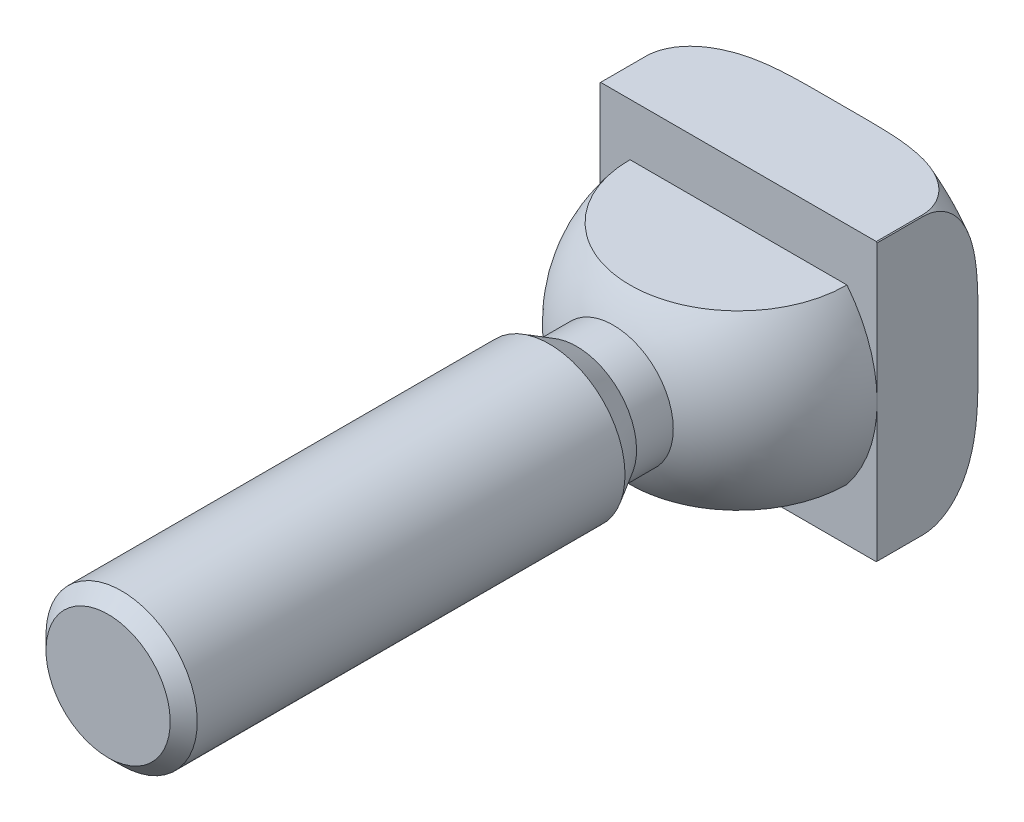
ISO-10303-21;
HEADER;
FILE_DESCRIPTION(('STEP AP214'),'2;1');
FILE_NAME('part.step','',(''),(''),'','','');
FILE_SCHEMA(('AUTOMOTIVE_DESIGN { 1 0 10303 214 1 1 1 1 }'));
ENDSEC;
DATA;
#1=APPLICATION_CONTEXT('core data for automotive mechanical design processes');
#2=APPLICATION_PROTOCOL_DEFINITION('international standard','automotive_design',2000,#1);
#3=PRODUCT_CONTEXT('',#1,'mechanical');
#4=PRODUCT('Part','Part','',(#3));
#5=PRODUCT_RELATED_PRODUCT_CATEGORY('part','',(#4));
#6=PRODUCT_DEFINITION_FORMATION('','',#4);
#7=PRODUCT_DEFINITION_CONTEXT('part definition',#1,'design');
#8=PRODUCT_DEFINITION('design','',#6,#7);
#9=PRODUCT_DEFINITION_SHAPE('','',#8);
#10=(LENGTH_UNIT() NAMED_UNIT(*) SI_UNIT(.MILLI.,.METRE.));
#11=(NAMED_UNIT(*) PLANE_ANGLE_UNIT() SI_UNIT($,.RADIAN.));
#12=(NAMED_UNIT(*) SI_UNIT($,.STERADIAN.) SOLID_ANGLE_UNIT());
#13=UNCERTAINTY_MEASURE_WITH_UNIT(LENGTH_MEASURE(1.E-05),#10,'distance_accuracy_value','');
#14=(GEOMETRIC_REPRESENTATION_CONTEXT(3) GLOBAL_UNCERTAINTY_ASSIGNED_CONTEXT((#13)) GLOBAL_UNIT_ASSIGNED_CONTEXT((#10,
#11,#12)) REPRESENTATION_CONTEXT('',''));
#15=CARTESIAN_POINT('',(0.,0.,0.));
#16=DIRECTION('',(0.,0.,1.));
#17=DIRECTION('',(1.,0.,0.));
#18=AXIS2_PLACEMENT_3D('',#15,#16,#17);
#19=CARTESIAN_POINT('',(0.,0.,-3.6));
#20=DIRECTION('',(0.,0.,1.));
#21=DIRECTION('',(0.,-1.,0.));
#22=AXIS2_PLACEMENT_3D('',#19,#20,#21);
#23=TOROIDAL_SURFACE('',#22,11.11,4.4);
#24=CARTESIAN_POINT('',(11.,0.,-7.9986247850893));
#25=CARTESIAN_POINT('',(11.,0.244167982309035,-7.99862566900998));
#26=CARTESIAN_POINT('',(11.,0.488335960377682,-7.99885116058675));
#27=CARTESIAN_POINT('',(11.,0.976671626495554,-7.99948190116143));
#28=CARTESIAN_POINT('',(11.,1.22083931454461,-7.99988715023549));
#29=CARTESIAN_POINT('',(11.,1.70936602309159,-8.00007526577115));
#30=CARTESIAN_POINT('',(11.,1.95372504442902,-7.99985764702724));
#31=CARTESIAN_POINT('',(11.,2.44244295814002,-7.99751713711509));
#32=CARTESIAN_POINT('',(11.,2.6868018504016,-7.99539420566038));
#33=CARTESIAN_POINT('',(11.,3.17540494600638,-7.98754889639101));
#34=CARTESIAN_POINT('',(11.,3.41964916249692,-7.98182749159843));
#35=CARTESIAN_POINT('',(11.,3.90794771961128,-7.96474581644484));
#36=CARTESIAN_POINT('',(11.,4.15200206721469,-7.95338576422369));
#37=CARTESIAN_POINT('',(11.,4.63930745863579,-7.92271306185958));
#38=CARTESIAN_POINT('',(11.,4.88255914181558,-7.9034111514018));
#39=CARTESIAN_POINT('',(11.,5.36808047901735,-7.85426911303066));
#40=CARTESIAN_POINT('',(11.,5.61034994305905,-7.82442703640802));
#41=CARTESIAN_POINT('',(11.,6.09743926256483,-7.75070651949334));
#42=CARTESIAN_POINT('',(11.,6.34222210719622,-7.70657606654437));
#43=CARTESIAN_POINT('',(11.,6.82803907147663,-7.60128676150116));
#44=CARTESIAN_POINT('',(11.,7.06907525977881,-7.54013768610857));
#45=CARTESIAN_POINT('',(11.,7.544028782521,-7.39777029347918));
#46=CARTESIAN_POINT('',(11.,7.7779742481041,-7.31664763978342));
#47=CARTESIAN_POINT('',(11.,8.23621103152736,-7.13090753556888));
#48=CARTESIAN_POINT('',(11.,8.46051347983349,-7.02631808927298));
#49=CARTESIAN_POINT('',(11.,8.8893021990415,-6.79347114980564));
#50=CARTESIAN_POINT('',(11.,9.09414705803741,-6.66588219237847));
#51=CARTESIAN_POINT('',(11.,9.48435680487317,-6.38282448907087));
#52=CARTESIAN_POINT('',(11.,9.66970590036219,-6.22733341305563));
#53=CARTESIAN_POINT('',(11.,9.92764272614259,-5.9719759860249));
#54=CARTESIAN_POINT('',(11.,10.0107063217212,-5.88257142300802));
#55=CARTESIAN_POINT('',(11.,10.1684678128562,-5.69669341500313));
#56=CARTESIAN_POINT('',(11.,10.2431702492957,-5.6002238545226));
#57=CARTESIAN_POINT('',(11.,10.3828802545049,-5.400676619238));
#58=CARTESIAN_POINT('',(11.,10.4479014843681,-5.29760855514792));
#59=CARTESIAN_POINT('',(11.,10.5670841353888,-5.08542919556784));
#60=CARTESIAN_POINT('',(11.,10.6212496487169,-4.97632019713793));
#61=CARTESIAN_POINT('',(11.,10.7405401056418,-4.69947224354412));
#62=CARTESIAN_POINT('',(11.,10.7985709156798,-4.52858953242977));
#63=CARTESIAN_POINT('',(11.,10.8850617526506,-4.17956065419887));
#64=CARTESIAN_POINT('',(11.,10.9135367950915,-4.00141822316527));
#65=CARTESIAN_POINT('',(11.,10.9392736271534,-3.64253555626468));
#66=CARTESIAN_POINT('',(11.,10.9364796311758,-3.46179125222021));
#67=CARTESIAN_POINT('',(11.,10.8997077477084,-3.10351565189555));
#68=CARTESIAN_POINT('',(11.,10.8657258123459,-2.92598477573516));
#69=CARTESIAN_POINT('',(11.,10.7697974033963,-2.58326250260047));
#70=CARTESIAN_POINT('',(11.,10.7085296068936,-2.41787879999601));
#71=CARTESIAN_POINT('',(11.,10.5614224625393,-2.09852829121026));
#72=CARTESIAN_POINT('',(11.,10.4755802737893,-1.94456280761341));
#73=CARTESIAN_POINT('',(11.,10.2740206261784,-1.6365408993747));
#74=CARTESIAN_POINT('',(11.,10.1562554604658,-1.4838320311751));
#75=CARTESIAN_POINT('',(11.,9.90072963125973,-1.19621722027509));
#76=CARTESIAN_POINT('',(11.,9.76295152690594,-1.06132700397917));
#77=CARTESIAN_POINT('',(11.,9.38652000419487,-0.735758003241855));
#78=CARTESIAN_POINT('',(11.,9.13606286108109,-0.558702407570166));
#79=CARTESIAN_POINT('',(11.,8.61050942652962,-0.246656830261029));
#80=CARTESIAN_POINT('',(11.,8.33537675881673,-0.111730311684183));
#81=CARTESIAN_POINT('',(11.,7.82006748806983,0.101266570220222));
#82=CARTESIAN_POINT('',(11.,7.58222898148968,0.185159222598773));
#83=CARTESIAN_POINT('',(11.,7.10003595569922,0.331865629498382));
#84=CARTESIAN_POINT('',(11.,6.85567647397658,0.394662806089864));
#85=CARTESIAN_POINT('',(11.,6.36219645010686,0.502824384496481));
#86=CARTESIAN_POINT('',(11.,6.1130607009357,0.548117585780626));
#87=CARTESIAN_POINT('',(11.,5.61276963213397,0.624275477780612));
#88=CARTESIAN_POINT('',(11.,5.3616152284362,0.655146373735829));
#89=CARTESIAN_POINT('',(11.,4.78187506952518,0.713294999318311));
#90=CARTESIAN_POINT('',(11.,4.45290899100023,0.736642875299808));
#91=CARTESIAN_POINT('',(11.,3.79428225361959,0.770498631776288));
#92=CARTESIAN_POINT('',(11.,3.46462137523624,0.781001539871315));
#93=CARTESIAN_POINT('',(11.,2.80475297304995,0.794523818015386));
#94=CARTESIAN_POINT('',(11.,2.47454529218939,0.797533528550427));
#95=CARTESIAN_POINT('',(11.,1.81418154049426,0.800324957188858));
#96=CARTESIAN_POINT('',(11.,1.48402546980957,0.800107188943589));
#97=CARTESIAN_POINT('',(11.,0.823934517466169,0.799332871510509));
#98=CARTESIAN_POINT('',(11.,0.493999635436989,0.798776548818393));
#99=CARTESIAN_POINT('',(11.,-0.165885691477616,0.798533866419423));
#100=CARTESIAN_POINT('',(11.,-0.495836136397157,0.798847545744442));
#101=CARTESIAN_POINT('',(11.,-1.15553605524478,0.799731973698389));
#102=CARTESIAN_POINT('',(11.,-1.48528553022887,0.800302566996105));
#103=CARTESIAN_POINT('',(11.,-2.14477656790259,0.799356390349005));
#104=CARTESIAN_POINT('',(11.,-2.47451813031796,0.797839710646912));
#105=CARTESIAN_POINT('',(11.,-3.04438053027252,0.790080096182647));
#106=CARTESIAN_POINT('',(11.,-3.28451680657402,0.785232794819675));
#107=CARTESIAN_POINT('',(11.,-3.76466882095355,0.770480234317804));
#108=CARTESIAN_POINT('',(11.,-4.00468454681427,0.760574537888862));
#109=CARTESIAN_POINT('',(11.,-4.48464487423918,0.733525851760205));
#110=CARTESIAN_POINT('',(11.,-4.72458897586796,0.716373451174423));
#111=CARTESIAN_POINT('',(11.,-5.20361397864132,0.672406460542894));
#112=CARTESIAN_POINT('',(11.,-5.44269491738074,0.645592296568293));
#113=CARTESIAN_POINT('',(11.,-5.92237388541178,0.579216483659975));
#114=CARTESIAN_POINT('',(11.,-6.1629497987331,0.539490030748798));
#115=CARTESIAN_POINT('',(11.,-6.64113749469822,0.444417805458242));
#116=CARTESIAN_POINT('',(11.,-6.87874845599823,0.38906780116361));
#117=CARTESIAN_POINT('',(11.,-7.34813652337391,0.259819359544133));
#118=CARTESIAN_POINT('',(11.,-7.57993016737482,0.18598217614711));
#119=CARTESIAN_POINT('',(11.,-8.03538420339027,0.0165125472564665));
#120=CARTESIAN_POINT('',(11.,-8.2590498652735,-0.0791054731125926));
#121=CARTESIAN_POINT('',(11.,-8.70040739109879,-0.298322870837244));
#122=CARTESIAN_POINT('',(11.,-8.91774655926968,-0.422642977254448));
#123=CARTESIAN_POINT('',(11.,-9.33339082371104,-0.700649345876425));
#124=CARTESIAN_POINT('',(11.,-9.53169018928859,-0.85434440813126));
#125=CARTESIAN_POINT('',(11.,-9.80930539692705,-1.10870064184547));
#126=CARTESIAN_POINT('',(11.,-9.89904640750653,-1.19810417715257));
#127=CARTESIAN_POINT('',(11.,-10.0700814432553,-1.38462017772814));
#128=CARTESIAN_POINT('',(11.,-10.1513803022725,-1.48172817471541));
#129=CARTESIAN_POINT('',(11.,-10.3040772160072,-1.6832606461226));
#130=CARTESIAN_POINT('',(11.,-10.3754890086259,-1.78767465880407));
#131=CARTESIAN_POINT('',(11.,-10.5070935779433,-2.00328733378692));
#132=CARTESIAN_POINT('',(11.,-10.5672911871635,-2.11448304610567));
#133=CARTESIAN_POINT('',(11.,-10.6985537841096,-2.39251409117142));
#134=CARTESIAN_POINT('',(11.,-10.7629998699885,-2.56255583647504));
#135=CARTESIAN_POINT('',(11.,-10.862440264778,-2.91098018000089));
#136=CARTESIAN_POINT('',(11.,-10.8974518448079,-3.08935782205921));
#137=CARTESIAN_POINT('',(11.,-10.9360122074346,-3.44995476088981));
#138=CARTESIAN_POINT('',(11.,-10.939487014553,-3.63218208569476));
#139=CARTESIAN_POINT('',(11.,-10.9145419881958,-3.99443117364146));
#140=CARTESIAN_POINT('',(11.,-10.8861197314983,-4.17445276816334));
#141=CARTESIAN_POINT('',(11.,-10.8006529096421,-4.52098257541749));
#142=CARTESIAN_POINT('',(11.,-10.7446134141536,-4.68774209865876));
#143=CARTESIAN_POINT('',(11.,-10.6074145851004,-5.01050120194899));
#144=CARTESIAN_POINT('',(11.,-10.5262513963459,-5.1664991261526));
#145=CARTESIAN_POINT('',(11.,-10.3348573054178,-5.47752748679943));
#146=CARTESIAN_POINT('',(11.,-10.2227798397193,-5.63141482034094));
#147=CARTESIAN_POINT('',(11.,-9.97826988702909,-5.92196783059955));
#148=CARTESIAN_POINT('',(11.,-9.84582459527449,-6.05862257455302));
#149=CARTESIAN_POINT('',(11.,-9.48633467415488,-6.38591323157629));
#150=CARTESIAN_POINT('',(11.,-9.24782164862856,-6.56397460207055));
#151=CARTESIAN_POINT('',(11.,-8.74555737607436,-6.87988293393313));
#152=CARTESIAN_POINT('',(11.,-8.48175205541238,-7.01764106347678));
#153=CARTESIAN_POINT('',(11.,-7.99126740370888,-7.23459728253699));
#154=CARTESIAN_POINT('',(11.,-7.76724215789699,-7.31996551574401));
#155=CARTESIAN_POINT('',(11.,-7.31248611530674,-7.47076953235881));
#156=CARTESIAN_POINT('',(11.,-7.08175056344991,-7.5361907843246));
#157=CARTESIAN_POINT('',(11.,-6.61580785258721,-7.6501637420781));
#158=CARTESIAN_POINT('',(11.,-6.38059348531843,-7.69868530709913));
#159=CARTESIAN_POINT('',(11.,-5.90765678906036,-7.78166493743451));
#160=CARTESIAN_POINT('',(11.,-5.6699334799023,-7.81611728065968));
#161=CARTESIAN_POINT('',(11.,-5.20678918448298,-7.87205097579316));
#162=CARTESIAN_POINT('',(11.,-4.98144154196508,-7.89416108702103));
#163=CARTESIAN_POINT('',(11.,-4.53016547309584,-7.93045973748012));
#164=CARTESIAN_POINT('',(11.,-4.30423713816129,-7.94464945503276));
#165=CARTESIAN_POINT('',(11.,-3.85190033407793,-7.96709033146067));
#166=CARTESIAN_POINT('',(11.,-3.62549161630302,-7.97533617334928));
#167=CARTESIAN_POINT('',(11.,-3.17256308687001,-7.98764124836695));
#168=CARTESIAN_POINT('',(11.,-2.94604327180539,-7.99170034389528));
#169=CARTESIAN_POINT('',(11.,-2.49282649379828,-7.99717570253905));
#170=CARTESIAN_POINT('',(11.,-2.26612951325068,-7.99859020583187));
#171=CARTESIAN_POINT('',(11.,-1.81273701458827,-8.00004599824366));
#172=CARTESIAN_POINT('',(11.,-1.58604149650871,-8.00008730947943));
#173=CARTESIAN_POINT('',(11.,-1.13278850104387,-7.99975527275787));
#174=CARTESIAN_POINT('',(11.,-0.906231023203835,-7.99938217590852));
#175=CARTESIAN_POINT('',(11.,-0.453115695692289,-7.99881652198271));
#176=CARTESIAN_POINT('',(11.,-0.226557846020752,-7.99862396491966));
#177=CARTESIAN_POINT('',(11.,0.,-7.9986247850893));
#178=B_SPLINE_CURVE_WITH_KNOTS('',3,(#24,#25,#26,#27,#28,#29,#30,#31,#32,#33,#34,#35,#36,#37,
#38,#39,#40,#41,#42,#43,#44,#45,#46,#47,#48,#49,#50,#51,#52,#53,#54,#55,#56,#57,#58,#59,#60,#61,
#62,#63,#64,#65,#66,#67,#68,#69,#70,#71,#72,#73,#74,#75,#76,#77,#78,#79,#80,#81,#82,#83,#84,#85,
#86,#87,#88,#89,#90,#91,#92,#93,#94,#95,#96,#97,#98,#99,#100,#101,#102,#103,#104,#105,#106,#107,
#108,#109,#110,#111,#112,#113,#114,#115,#116,#117,#118,#119,#120,#121,#122,#123,#124,#125,#126,
#127,#128,#129,#130,#131,#132,#133,#134,#135,#136,#137,#138,#139,#140,#141,#142,#143,#144,#145,
#146,#147,#148,#149,#150,#151,#152,#153,#154,#155,#156,#157,#158,#159,#160,#161,#162,#163,#164,
#165,#166,#167,#168,#169,#170,#171,#172,#173,#174,#175,#176,#177),.UNSPECIFIED.,.T.,.F.,(4,2,2,
2,2,2,2,2,2,2,2,2,2,2,2,2,2,2,2,2,2,2,2,2,2,2,2,2,2,2,2,2,2,2,2,2,2,2,2,2,2,2,2,2,2,2,2,2,2,2,2,
2,2,2,2,2,2,2,2,2,2,2,2,2,2,2,2,2,2,2,2,2,2,2,2,2,4),(0.,0.732503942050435,1.46500819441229,
2.19808321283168,2.93117373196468,3.66406610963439,4.39693013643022,5.12880635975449,
5.86081796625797,6.60651638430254,7.35178730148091,8.09355590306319,8.83444397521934,
9.55651629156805,10.2791690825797,10.6448684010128,11.0103681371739,11.3753471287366,
11.74018827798,12.2790367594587,12.8176113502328,13.3571469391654,13.8967525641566,
14.4236273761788,14.9505631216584,15.5269516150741,16.1038454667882,17.0187682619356,
17.9350627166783,18.6905663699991,19.4466623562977,20.2058023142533,20.9646153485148,
21.9535833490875,22.9429340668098,23.9335595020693,24.9240272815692,25.9138331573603,
26.9036834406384,27.892936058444,28.8821459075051,29.6026681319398,30.3232526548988,
31.0447758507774,31.7662672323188,32.4973547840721,33.2286405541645,33.9575346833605,
34.6859474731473,35.4351499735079,36.1845772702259,36.5641726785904,36.9435495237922,
37.3223938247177,37.7010744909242,38.2440729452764,38.7867525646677,39.3307048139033,
39.8746983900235,40.4002130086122,40.9258083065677,41.4947952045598,42.0641412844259,
42.9520282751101,43.8418577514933,44.5600475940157,45.2787593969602,45.9987465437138,
46.7190262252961,47.3981425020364,48.0771577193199,48.7567795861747,49.436423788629,
50.1165200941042,50.7966054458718,51.4762789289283,52.1559524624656),.UNSPECIFIED.);
#179=CARTESIAN_POINT('',(11.,1.55951915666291,-8.));
#180=VERTEX_POINT('',#179);
#181=CARTESIAN_POINT('',(11.,10.9343541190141,-3.6));
#182=VERTEX_POINT('',#181);
#183=EDGE_CURVE('E216',#180,#182,#178,.T.);
#184=ORIENTED_EDGE('',*,*,#183,.F.);
#185=CARTESIAN_POINT('',(0.,0.,-8.));
#186=DIRECTION('',(0.,0.,1.));
#187=DIRECTION('',(0.,-1.,0.));
#188=AXIS2_PLACEMENT_3D('',#185,#186,#187);
#189=CIRCLE('',#188,11.11);
#190=CARTESIAN_POINT('',(1.55951915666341,11.,-8.));
#191=VERTEX_POINT('',#190);
#192=EDGE_CURVE('E291',#180,#191,#189,.T.);
#193=ORIENTED_EDGE('',*,*,#192,.T.);
#194=CARTESIAN_POINT('',(0.,11.,-7.9986247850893));
#195=CARTESIAN_POINT('',(-0.244167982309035,11.,-7.99862566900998));
#196=CARTESIAN_POINT('',(-0.488335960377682,11.,-7.99885116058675));
#197=CARTESIAN_POINT('',(-0.976671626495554,11.,-7.99948190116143));
#198=CARTESIAN_POINT('',(-1.22083931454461,11.,-7.99988715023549));
#199=CARTESIAN_POINT('',(-1.70936602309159,11.,-8.00007526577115));
#200=CARTESIAN_POINT('',(-1.95372504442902,11.,-7.99985764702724));
#201=CARTESIAN_POINT('',(-2.44244295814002,11.,-7.99751713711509));
#202=CARTESIAN_POINT('',(-2.6868018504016,11.,-7.99539420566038));
#203=CARTESIAN_POINT('',(-3.17540494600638,11.,-7.98754889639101));
#204=CARTESIAN_POINT('',(-3.41964916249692,11.,-7.98182749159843));
#205=CARTESIAN_POINT('',(-3.90794771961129,11.,-7.96474581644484));
#206=CARTESIAN_POINT('',(-4.15200206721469,11.,-7.95338576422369));
#207=CARTESIAN_POINT('',(-4.6393074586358,11.,-7.92271306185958));
#208=CARTESIAN_POINT('',(-4.88255914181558,11.,-7.90341115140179));
#209=CARTESIAN_POINT('',(-5.36808047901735,11.,-7.85426911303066));
#210=CARTESIAN_POINT('',(-5.61034994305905,11.,-7.82442703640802));
#211=CARTESIAN_POINT('',(-6.09743926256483,11.,-7.75070651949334));
#212=CARTESIAN_POINT('',(-6.34222210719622,11.,-7.70657606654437));
#213=CARTESIAN_POINT('',(-6.82803907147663,11.,-7.60128676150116));
#214=CARTESIAN_POINT('',(-7.06907525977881,11.,-7.54013768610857));
#215=CARTESIAN_POINT('',(-7.544028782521,11.,-7.39777029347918));
#216=CARTESIAN_POINT('',(-7.7779742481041,11.,-7.31664763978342));
#217=CARTESIAN_POINT('',(-8.23621103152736,11.,-7.13090753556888));
#218=CARTESIAN_POINT('',(-8.46051347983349,11.,-7.02631808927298));
#219=CARTESIAN_POINT('',(-8.8893021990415,11.,-6.79347114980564));
#220=CARTESIAN_POINT('',(-9.09414705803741,11.,-6.66588219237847));
#221=CARTESIAN_POINT('',(-9.48435680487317,11.,-6.38282448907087));
#222=CARTESIAN_POINT('',(-9.66970590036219,11.,-6.22733341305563));
#223=CARTESIAN_POINT('',(-9.92764272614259,11.,-5.9719759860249));
#224=CARTESIAN_POINT('',(-10.0107063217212,11.,-5.88257142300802));
#225=CARTESIAN_POINT('',(-10.1684678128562,11.,-5.69669341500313));
#226=CARTESIAN_POINT('',(-10.2431702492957,11.,-5.6002238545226));
#227=CARTESIAN_POINT('',(-10.3828802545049,11.,-5.400676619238));
#228=CARTESIAN_POINT('',(-10.4479014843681,11.,-5.29760855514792));
#229=CARTESIAN_POINT('',(-10.5670841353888,11.,-5.08542919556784));
#230=CARTESIAN_POINT('',(-10.6212496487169,11.,-4.97632019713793));
#231=CARTESIAN_POINT('',(-10.7405401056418,11.,-4.69947224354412));
#232=CARTESIAN_POINT('',(-10.7985709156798,11.,-4.52858953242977));
#233=CARTESIAN_POINT('',(-10.8850617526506,11.,-4.17956065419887));
#234=CARTESIAN_POINT('',(-10.9135367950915,11.,-4.00141822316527));
#235=CARTESIAN_POINT('',(-10.9392736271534,11.,-3.64253555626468));
#236=CARTESIAN_POINT('',(-10.9364796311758,11.,-3.46179125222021));
#237=CARTESIAN_POINT('',(-10.8997077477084,11.,-3.10351565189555));
#238=CARTESIAN_POINT('',(-10.8657258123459,11.,-2.92598477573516));
#239=CARTESIAN_POINT('',(-10.7697974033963,11.,-2.58326250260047));
#240=CARTESIAN_POINT('',(-10.7085296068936,11.,-2.41787879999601));
#241=CARTESIAN_POINT('',(-10.5614224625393,11.,-2.09852829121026));
#242=CARTESIAN_POINT('',(-10.4755802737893,11.,-1.94456280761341));
#243=CARTESIAN_POINT('',(-10.2740206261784,11.,-1.6365408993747));
#244=CARTESIAN_POINT('',(-10.1562554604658,11.,-1.4838320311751));
#245=CARTESIAN_POINT('',(-9.90072963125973,11.,-1.19621722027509));
#246=CARTESIAN_POINT('',(-9.76295152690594,11.,-1.06132700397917));
#247=CARTESIAN_POINT('',(-9.38652000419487,11.,-0.735758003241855));
#248=CARTESIAN_POINT('',(-9.13606286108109,11.,-0.558702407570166));
#249=CARTESIAN_POINT('',(-8.61050942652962,11.,-0.246656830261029));
#250=CARTESIAN_POINT('',(-8.33537675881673,11.,-0.111730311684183));
#251=CARTESIAN_POINT('',(-7.82006748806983,11.,0.101266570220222));
#252=CARTESIAN_POINT('',(-7.58222898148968,11.,0.185159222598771));
#253=CARTESIAN_POINT('',(-7.10003595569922,11.,0.33186562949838));
#254=CARTESIAN_POINT('',(-6.85567647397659,11.,0.394662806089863));
#255=CARTESIAN_POINT('',(-6.36219645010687,11.,0.50282438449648));
#256=CARTESIAN_POINT('',(-6.11306070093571,11.,0.548117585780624));
#257=CARTESIAN_POINT('',(-5.61276963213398,11.,0.62427547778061));
#258=CARTESIAN_POINT('',(-5.36161522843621,11.,0.655146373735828));
#259=CARTESIAN_POINT('',(-4.78187506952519,11.,0.713294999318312));
#260=CARTESIAN_POINT('',(-4.45290899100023,11.,0.736642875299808));
#261=CARTESIAN_POINT('',(-3.79428225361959,11.,0.770498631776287));
#262=CARTESIAN_POINT('',(-3.46462137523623,11.,0.781001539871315));
#263=CARTESIAN_POINT('',(-2.80475297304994,11.,0.794523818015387));
#264=CARTESIAN_POINT('',(-2.47454529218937,11.,0.797533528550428));
#265=CARTESIAN_POINT('',(-1.81418154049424,11.,0.800324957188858));
#266=CARTESIAN_POINT('',(-1.48402546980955,11.,0.800107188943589));
#267=CARTESIAN_POINT('',(-0.823934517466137,11.,0.799332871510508));
#268=CARTESIAN_POINT('',(-0.493999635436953,11.,0.798776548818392));
#269=CARTESIAN_POINT('',(0.165885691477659,11.,0.798533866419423));
#270=CARTESIAN_POINT('',(0.495836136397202,11.,0.798847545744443));
#271=CARTESIAN_POINT('',(1.15553605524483,11.,0.79973197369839));
#272=CARTESIAN_POINT('',(1.48528553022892,11.,0.800302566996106));
#273=CARTESIAN_POINT('',(2.14477656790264,11.,0.799356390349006));
#274=CARTESIAN_POINT('',(2.47451813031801,11.,0.797839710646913));
#275=CARTESIAN_POINT('',(3.04438053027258,11.,0.790080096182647));
#276=CARTESIAN_POINT('',(3.28451680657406,11.,0.785232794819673));
#277=CARTESIAN_POINT('',(3.76466882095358,11.,0.770480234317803));
#278=CARTESIAN_POINT('',(4.00468454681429,11.,0.760574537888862));
#279=CARTESIAN_POINT('',(4.48464487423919,11.,0.733525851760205));
#280=CARTESIAN_POINT('',(4.72458897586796,11.,0.716373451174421));
#281=CARTESIAN_POINT('',(5.2036139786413,11.,0.672406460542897));
#282=CARTESIAN_POINT('',(5.44269491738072,11.,0.645592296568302));
#283=CARTESIAN_POINT('',(5.92237388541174,11.,0.579216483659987));
#284=CARTESIAN_POINT('',(6.16294979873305,11.,0.539490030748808));
#285=CARTESIAN_POINT('',(6.64113749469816,11.,0.444417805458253));
#286=CARTESIAN_POINT('',(6.87874845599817,11.,0.389067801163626));
#287=CARTESIAN_POINT('',(7.34813652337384,11.,0.259819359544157));
#288=CARTESIAN_POINT('',(7.57993016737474,11.,0.185982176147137));
#289=CARTESIAN_POINT('',(8.03538420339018,11.,0.0165125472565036));
#290=CARTESIAN_POINT('',(8.2590498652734,11.,-0.0791054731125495));
#291=CARTESIAN_POINT('',(8.70040739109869,11.,-0.298322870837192));
#292=CARTESIAN_POINT('',(8.91774655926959,11.,-0.422642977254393));
#293=CARTESIAN_POINT('',(9.33339082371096,11.,-0.700649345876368));
#294=CARTESIAN_POINT('',(9.53169018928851,11.,-0.854344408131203));
#295=CARTESIAN_POINT('',(9.80930539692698,11.,-1.10870064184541));
#296=CARTESIAN_POINT('',(9.89904640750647,11.,-1.19810417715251));
#297=CARTESIAN_POINT('',(10.0700814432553,11.,-1.38462017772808));
#298=CARTESIAN_POINT('',(10.1513803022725,11.,-1.48172817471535));
#299=CARTESIAN_POINT('',(10.3040772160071,11.,-1.68326064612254));
#300=CARTESIAN_POINT('',(10.3754890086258,11.,-1.78767465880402));
#301=CARTESIAN_POINT('',(10.5070935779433,11.,-2.00328733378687));
#302=CARTESIAN_POINT('',(10.5672911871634,11.,-2.11448304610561));
#303=CARTESIAN_POINT('',(10.6985537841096,11.,-2.39251409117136));
#304=CARTESIAN_POINT('',(10.7629998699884,11.,-2.56255583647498));
#305=CARTESIAN_POINT('',(10.8624402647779,11.,-2.91098018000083));
#306=CARTESIAN_POINT('',(10.8974518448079,11.,-3.08935782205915));
#307=CARTESIAN_POINT('',(10.9360122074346,11.,-3.44995476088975));
#308=CARTESIAN_POINT('',(10.939487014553,11.,-3.6321820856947));
#309=CARTESIAN_POINT('',(10.9145419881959,11.,-3.9944311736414));
#310=CARTESIAN_POINT('',(10.8861197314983,11.,-4.17445276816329));
#311=CARTESIAN_POINT('',(10.8006529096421,11.,-4.52098257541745));
#312=CARTESIAN_POINT('',(10.7446134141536,11.,-4.68774209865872));
#313=CARTESIAN_POINT('',(10.6074145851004,11.,-5.01050120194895));
#314=CARTESIAN_POINT('',(10.5262513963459,11.,-5.16649912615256));
#315=CARTESIAN_POINT('',(10.3348573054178,11.,-5.47752748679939));
#316=CARTESIAN_POINT('',(10.2227798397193,11.,-5.63141482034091));
#317=CARTESIAN_POINT('',(9.97826988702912,11.,-5.92196783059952));
#318=CARTESIAN_POINT('',(9.84582459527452,11.,-6.05862257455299));
#319=CARTESIAN_POINT('',(9.48633467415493,11.,-6.38591323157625));
#320=CARTESIAN_POINT('',(9.24782164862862,11.,-6.56397460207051));
#321=CARTESIAN_POINT('',(8.74555737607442,11.,-6.8798829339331));
#322=CARTESIAN_POINT('',(8.48175205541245,11.,-7.01764106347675));
#323=CARTESIAN_POINT('',(7.99126740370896,11.,-7.23459728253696));
#324=CARTESIAN_POINT('',(7.76724215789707,11.,-7.31996551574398));
#325=CARTESIAN_POINT('',(7.31248611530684,11.,-7.47076953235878));
#326=CARTESIAN_POINT('',(7.08175056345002,11.,-7.53619078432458));
#327=CARTESIAN_POINT('',(6.61580785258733,11.,-7.65016374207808));
#328=CARTESIAN_POINT('',(6.38059348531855,11.,-7.6986853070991));
#329=CARTESIAN_POINT('',(5.90765678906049,11.,-7.78166493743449));
#330=CARTESIAN_POINT('',(5.66993347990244,11.,-7.81611728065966));
#331=CARTESIAN_POINT('',(5.20678918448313,11.,-7.87205097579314));
#332=CARTESIAN_POINT('',(4.98144154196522,11.,-7.89416108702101));
#333=CARTESIAN_POINT('',(4.53016547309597,11.,-7.93045973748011));
#334=CARTESIAN_POINT('',(4.30423713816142,11.,-7.94464945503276));
#335=CARTESIAN_POINT('',(3.85190033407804,11.,-7.96709033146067));
#336=CARTESIAN_POINT('',(3.62549161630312,11.,-7.97533617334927));
#337=CARTESIAN_POINT('',(3.17256308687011,11.,-7.98764124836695));
#338=CARTESIAN_POINT('',(2.94604327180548,11.,-7.99170034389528));
#339=CARTESIAN_POINT('',(2.49282649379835,11.,-7.99717570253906));
#340=CARTESIAN_POINT('',(2.26612951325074,11.,-7.99859020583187));
#341=CARTESIAN_POINT('',(1.81273701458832,11.,-8.00004599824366));
#342=CARTESIAN_POINT('',(1.58604149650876,11.,-8.00008730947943));
#343=CARTESIAN_POINT('',(1.1327885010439,11.,-7.99975527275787));
#344=CARTESIAN_POINT('',(0.906231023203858,11.,-7.99938217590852));
#345=CARTESIAN_POINT('',(0.453115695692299,11.,-7.99881652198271));
#346=CARTESIAN_POINT('',(0.226557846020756,11.,-7.99862396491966));
#347=CARTESIAN_POINT('',(0.,11.,-7.9986247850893));
#348=B_SPLINE_CURVE_WITH_KNOTS('',3,(#194,#195,#196,#197,#198,#199,#200,#201,#202,#203,#204,
#205,#206,#207,#208,#209,#210,#211,#212,#213,#214,#215,#216,#217,#218,#219,#220,#221,#222,#223,
#224,#225,#226,#227,#228,#229,#230,#231,#232,#233,#234,#235,#236,#237,#238,#239,#240,#241,#242,
#243,#244,#245,#246,#247,#248,#249,#250,#251,#252,#253,#254,#255,#256,#257,#258,#259,#260,#261,
#262,#263,#264,#265,#266,#267,#268,#269,#270,#271,#272,#273,#274,#275,#276,#277,#278,#279,#280,
#281,#282,#283,#284,#285,#286,#287,#288,#289,#290,#291,#292,#293,#294,#295,#296,#297,#298,#299,
#300,#301,#302,#303,#304,#305,#306,#307,#308,#309,#310,#311,#312,#313,#314,#315,#316,#317,#318,
#319,#320,#321,#322,#323,#324,#325,#326,#327,#328,#329,#330,#331,#332,#333,#334,#335,#336,#337,
#338,#339,#340,#341,#342,#343,#344,#345,#346,#347),.UNSPECIFIED.,.T.,.F.,(4,2,2,2,2,2,2,2,2,2,2,
2,2,2,2,2,2,2,2,2,2,2,2,2,2,2,2,2,2,2,2,2,2,2,2,2,2,2,2,2,2,2,2,2,2,2,2,2,2,2,2,2,2,2,2,2,2,2,2,
2,2,2,2,2,2,2,2,2,2,2,2,2,2,2,2,2,4),(0.,0.732503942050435,1.46500819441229,2.19808321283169,
2.93117373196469,3.66406610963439,4.39693013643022,5.12880635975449,5.86081796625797,
6.60651638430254,7.3517873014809,8.09355590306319,8.83444397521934,9.55651629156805,
10.2791690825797,10.6448684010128,11.0103681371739,11.3753471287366,11.74018827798,
12.2790367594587,12.8176113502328,13.3571469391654,13.8967525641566,14.4236273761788,
14.9505631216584,15.5269516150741,16.1038454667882,17.0187682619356,17.9350627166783,
18.6905663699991,19.4466623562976,20.2058023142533,20.9646153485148,21.9535833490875,
22.9429340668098,23.9335595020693,24.9240272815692,25.9138331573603,26.9036834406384,
27.892936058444,28.8821459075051,29.6026681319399,30.3232526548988,31.0447758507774,
31.7662672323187,32.4973547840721,33.2286405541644,33.9575346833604,34.6859474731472,
35.4351499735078,36.1845772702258,36.5641726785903,36.9435495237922,37.3223938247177,
37.7010744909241,38.2440729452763,38.7867525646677,39.3307048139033,39.8746983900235,
40.4002130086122,40.9258083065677,41.4947952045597,42.0641412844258,42.95202827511,
43.8418577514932,44.5600475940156,45.2787593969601,45.9987465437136,46.7190262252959,
47.3981425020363,48.0771577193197,48.7567795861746,49.4364237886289,50.1165200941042,
50.7966054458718,51.4762789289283,52.1559524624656),.UNSPECIFIED.);
#349=CARTESIAN_POINT('',(10.9343541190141,11.,-3.6));
#350=VERTEX_POINT('',#349);
#351=EDGE_CURVE('E177',#350,#191,#348,.T.);
#352=ORIENTED_EDGE('',*,*,#351,.F.);
#353=CARTESIAN_POINT('',(0.,0.,-3.6));
#354=DIRECTION('',(0.,0.,1.));
#355=DIRECTION('',(0.,-1.,0.));
#356=AXIS2_PLACEMENT_3D('',#353,#354,#355);
#357=CIRCLE('',#356,15.51);
#358=EDGE_CURVE('E174',#182,#350,#357,.T.);
#359=ORIENTED_EDGE('',*,*,#358,.F.);
#360=EDGE_LOOP('',(#184,#193,#352,#359));
#361=FACE_BOUND('',#360,.T.);
#362=ADVANCED_FACE('F14',(#361),#23,.T.);
#363=CARTESIAN_POINT('',(-1.55951915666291,11.,-8.));
#364=VERTEX_POINT('',#363);
#365=CARTESIAN_POINT('',(-10.9343541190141,11.,-3.6));
#366=VERTEX_POINT('',#365);
#367=EDGE_CURVE('E180',#364,#366,#348,.T.);
#368=ORIENTED_EDGE('',*,*,#367,.F.);
#369=CARTESIAN_POINT('',(-11.,1.5595191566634,-8.));
#370=VERTEX_POINT('',#369);
#371=EDGE_CURVE('E288',#364,#370,#189,.T.);
#372=ORIENTED_EDGE('',*,*,#371,.T.);
#373=CARTESIAN_POINT('',(-11.,0.,-7.9986247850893));
#374=CARTESIAN_POINT('',(-11.,-0.244167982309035,-7.99862566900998));
#375=CARTESIAN_POINT('',(-11.,-0.488335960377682,-7.99885116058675));
#376=CARTESIAN_POINT('',(-11.,-0.976671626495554,-7.99948190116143));
#377=CARTESIAN_POINT('',(-11.,-1.22083931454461,-7.99988715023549));
#378=CARTESIAN_POINT('',(-11.,-1.70936602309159,-8.00007526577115));
#379=CARTESIAN_POINT('',(-11.,-1.95372504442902,-7.99985764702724));
#380=CARTESIAN_POINT('',(-11.,-2.44244295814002,-7.99751713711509));
#381=CARTESIAN_POINT('',(-11.,-2.6868018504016,-7.99539420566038));
#382=CARTESIAN_POINT('',(-11.,-3.17540494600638,-7.98754889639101));
#383=CARTESIAN_POINT('',(-11.,-3.41964916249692,-7.98182749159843));
#384=CARTESIAN_POINT('',(-11.,-3.90794771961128,-7.96474581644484));
#385=CARTESIAN_POINT('',(-11.,-4.15200206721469,-7.95338576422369));
#386=CARTESIAN_POINT('',(-11.,-4.63930745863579,-7.92271306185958));
#387=CARTESIAN_POINT('',(-11.,-4.88255914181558,-7.9034111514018));
#388=CARTESIAN_POINT('',(-11.,-5.36808047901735,-7.85426911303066));
#389=CARTESIAN_POINT('',(-11.,-5.61034994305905,-7.82442703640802));
#390=CARTESIAN_POINT('',(-11.,-6.09743926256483,-7.75070651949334));
#391=CARTESIAN_POINT('',(-11.,-6.34222210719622,-7.70657606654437));
#392=CARTESIAN_POINT('',(-11.,-6.82803907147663,-7.60128676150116));
#393=CARTESIAN_POINT('',(-11.,-7.06907525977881,-7.54013768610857));
#394=CARTESIAN_POINT('',(-11.,-7.544028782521,-7.39777029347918));
#395=CARTESIAN_POINT('',(-11.,-7.7779742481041,-7.31664763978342));
#396=CARTESIAN_POINT('',(-11.,-8.23621103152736,-7.13090753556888));
#397=CARTESIAN_POINT('',(-11.,-8.46051347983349,-7.02631808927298));
#398=CARTESIAN_POINT('',(-11.,-8.8893021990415,-6.79347114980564));
#399=CARTESIAN_POINT('',(-11.,-9.09414705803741,-6.66588219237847));
#400=CARTESIAN_POINT('',(-11.,-9.48435680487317,-6.38282448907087));
#401=CARTESIAN_POINT('',(-11.,-9.66970590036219,-6.22733341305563));
#402=CARTESIAN_POINT('',(-11.,-9.92764272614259,-5.9719759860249));
#403=CARTESIAN_POINT('',(-11.,-10.0107063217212,-5.88257142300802));
#404=CARTESIAN_POINT('',(-11.,-10.1684678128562,-5.69669341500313));
#405=CARTESIAN_POINT('',(-11.,-10.2431702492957,-5.6002238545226));
#406=CARTESIAN_POINT('',(-11.,-10.3828802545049,-5.400676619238));
#407=CARTESIAN_POINT('',(-11.,-10.4479014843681,-5.29760855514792));
#408=CARTESIAN_POINT('',(-11.,-10.5670841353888,-5.08542919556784));
#409=CARTESIAN_POINT('',(-11.,-10.6212496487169,-4.97632019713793));
#410=CARTESIAN_POINT('',(-11.,-10.7405401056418,-4.69947224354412));
#411=CARTESIAN_POINT('',(-11.,-10.7985709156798,-4.52858953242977));
#412=CARTESIAN_POINT('',(-11.,-10.8850617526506,-4.17956065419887));
#413=CARTESIAN_POINT('',(-11.,-10.9135367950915,-4.00141822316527));
#414=CARTESIAN_POINT('',(-11.,-10.9392736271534,-3.64253555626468));
#415=CARTESIAN_POINT('',(-11.,-10.9364796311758,-3.46179125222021));
#416=CARTESIAN_POINT('',(-11.,-10.8997077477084,-3.10351565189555));
#417=CARTESIAN_POINT('',(-11.,-10.8657258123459,-2.92598477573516));
#418=CARTESIAN_POINT('',(-11.,-10.7697974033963,-2.58326250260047));
#419=CARTESIAN_POINT('',(-11.,-10.7085296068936,-2.41787879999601));
#420=CARTESIAN_POINT('',(-11.,-10.5614224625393,-2.09852829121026));
#421=CARTESIAN_POINT('',(-11.,-10.4755802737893,-1.94456280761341));
#422=CARTESIAN_POINT('',(-11.,-10.2740206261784,-1.6365408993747));
#423=CARTESIAN_POINT('',(-11.,-10.1562554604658,-1.4838320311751));
#424=CARTESIAN_POINT('',(-11.,-9.90072963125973,-1.19621722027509));
#425=CARTESIAN_POINT('',(-11.,-9.76295152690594,-1.06132700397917));
#426=CARTESIAN_POINT('',(-11.,-9.38652000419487,-0.735758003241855));
#427=CARTESIAN_POINT('',(-11.,-9.13606286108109,-0.558702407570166));
#428=CARTESIAN_POINT('',(-11.,-8.61050942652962,-0.246656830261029));
#429=CARTESIAN_POINT('',(-11.,-8.33537675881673,-0.111730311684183));
#430=CARTESIAN_POINT('',(-11.,-7.82006748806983,0.101266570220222));
#431=CARTESIAN_POINT('',(-11.,-7.58222898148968,0.185159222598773));
#432=CARTESIAN_POINT('',(-11.,-7.10003595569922,0.331865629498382));
#433=CARTESIAN_POINT('',(-11.,-6.85567647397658,0.394662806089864));
#434=CARTESIAN_POINT('',(-11.,-6.36219645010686,0.502824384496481));
#435=CARTESIAN_POINT('',(-11.,-6.1130607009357,0.548117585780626));
#436=CARTESIAN_POINT('',(-11.,-5.61276963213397,0.624275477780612));
#437=CARTESIAN_POINT('',(-11.,-5.3616152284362,0.655146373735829));
#438=CARTESIAN_POINT('',(-11.,-4.78187506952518,0.713294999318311));
#439=CARTESIAN_POINT('',(-11.,-4.45290899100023,0.736642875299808));
#440=CARTESIAN_POINT('',(-11.,-3.79428225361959,0.770498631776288));
#441=CARTESIAN_POINT('',(-11.,-3.46462137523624,0.781001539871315));
#442=CARTESIAN_POINT('',(-11.,-2.80475297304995,0.794523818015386));
#443=CARTESIAN_POINT('',(-11.,-2.47454529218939,0.797533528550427));
#444=CARTESIAN_POINT('',(-11.,-1.81418154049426,0.800324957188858));
#445=CARTESIAN_POINT('',(-11.,-1.48402546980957,0.800107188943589));
#446=CARTESIAN_POINT('',(-11.,-0.823934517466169,0.799332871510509));
#447=CARTESIAN_POINT('',(-11.,-0.493999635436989,0.798776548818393));
#448=CARTESIAN_POINT('',(-11.,0.165885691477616,0.798533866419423));
#449=CARTESIAN_POINT('',(-11.,0.495836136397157,0.798847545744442));
#450=CARTESIAN_POINT('',(-11.,1.15553605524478,0.799731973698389));
#451=CARTESIAN_POINT('',(-11.,1.48528553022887,0.800302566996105));
#452=CARTESIAN_POINT('',(-11.,2.14477656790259,0.799356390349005));
#453=CARTESIAN_POINT('',(-11.,2.47451813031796,0.797839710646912));
#454=CARTESIAN_POINT('',(-11.,3.04438053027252,0.790080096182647));
#455=CARTESIAN_POINT('',(-11.,3.28451680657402,0.785232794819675));
#456=CARTESIAN_POINT('',(-11.,3.76466882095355,0.770480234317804));
#457=CARTESIAN_POINT('',(-11.,4.00468454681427,0.760574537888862));
#458=CARTESIAN_POINT('',(-11.,4.48464487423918,0.733525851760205));
#459=CARTESIAN_POINT('',(-11.,4.72458897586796,0.716373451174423));
#460=CARTESIAN_POINT('',(-11.,5.20361397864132,0.672406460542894));
#461=CARTESIAN_POINT('',(-11.,5.44269491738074,0.645592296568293));
#462=CARTESIAN_POINT('',(-11.,5.92237388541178,0.579216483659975));
#463=CARTESIAN_POINT('',(-11.,6.1629497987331,0.539490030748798));
#464=CARTESIAN_POINT('',(-11.,6.64113749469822,0.444417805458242));
#465=CARTESIAN_POINT('',(-11.,6.87874845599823,0.38906780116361));
#466=CARTESIAN_POINT('',(-11.,7.34813652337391,0.259819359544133));
#467=CARTESIAN_POINT('',(-11.,7.57993016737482,0.18598217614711));
#468=CARTESIAN_POINT('',(-11.,8.03538420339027,0.0165125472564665));
#469=CARTESIAN_POINT('',(-11.,8.2590498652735,-0.0791054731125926));
#470=CARTESIAN_POINT('',(-11.,8.70040739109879,-0.298322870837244));
#471=CARTESIAN_POINT('',(-11.,8.91774655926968,-0.422642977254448));
#472=CARTESIAN_POINT('',(-11.,9.33339082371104,-0.700649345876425));
#473=CARTESIAN_POINT('',(-11.,9.53169018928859,-0.85434440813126));
#474=CARTESIAN_POINT('',(-11.,9.80930539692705,-1.10870064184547));
#475=CARTESIAN_POINT('',(-11.,9.89904640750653,-1.19810417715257));
#476=CARTESIAN_POINT('',(-11.,10.0700814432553,-1.38462017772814));
#477=CARTESIAN_POINT('',(-11.,10.1513803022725,-1.48172817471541));
#478=CARTESIAN_POINT('',(-11.,10.3040772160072,-1.6832606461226));
#479=CARTESIAN_POINT('',(-11.,10.3754890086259,-1.78767465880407));
#480=CARTESIAN_POINT('',(-11.,10.5070935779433,-2.00328733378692));
#481=CARTESIAN_POINT('',(-11.,10.5672911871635,-2.11448304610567));
#482=CARTESIAN_POINT('',(-11.,10.6985537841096,-2.39251409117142));
#483=CARTESIAN_POINT('',(-11.,10.7629998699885,-2.56255583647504));
#484=CARTESIAN_POINT('',(-11.,10.862440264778,-2.91098018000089));
#485=CARTESIAN_POINT('',(-11.,10.8974518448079,-3.08935782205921));
#486=CARTESIAN_POINT('',(-11.,10.9360122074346,-3.44995476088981));
#487=CARTESIAN_POINT('',(-11.,10.939487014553,-3.63218208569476));
#488=CARTESIAN_POINT('',(-11.,10.9145419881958,-3.99443117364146));
#489=CARTESIAN_POINT('',(-11.,10.8861197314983,-4.17445276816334));
#490=CARTESIAN_POINT('',(-11.,10.8006529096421,-4.52098257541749));
#491=CARTESIAN_POINT('',(-11.,10.7446134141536,-4.68774209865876));
#492=CARTESIAN_POINT('',(-11.,10.6074145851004,-5.01050120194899));
#493=CARTESIAN_POINT('',(-11.,10.5262513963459,-5.1664991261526));
#494=CARTESIAN_POINT('',(-11.,10.3348573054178,-5.47752748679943));
#495=CARTESIAN_POINT('',(-11.,10.2227798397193,-5.63141482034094));
#496=CARTESIAN_POINT('',(-11.,9.97826988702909,-5.92196783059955));
#497=CARTESIAN_POINT('',(-11.,9.84582459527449,-6.05862257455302));
#498=CARTESIAN_POINT('',(-11.,9.48633467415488,-6.38591323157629));
#499=CARTESIAN_POINT('',(-11.,9.24782164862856,-6.56397460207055));
#500=CARTESIAN_POINT('',(-11.,8.74555737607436,-6.87988293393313));
#501=CARTESIAN_POINT('',(-11.,8.48175205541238,-7.01764106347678));
#502=CARTESIAN_POINT('',(-11.,7.99126740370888,-7.23459728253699));
#503=CARTESIAN_POINT('',(-11.,7.76724215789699,-7.31996551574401));
#504=CARTESIAN_POINT('',(-11.,7.31248611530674,-7.47076953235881));
#505=CARTESIAN_POINT('',(-11.,7.08175056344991,-7.5361907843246));
#506=CARTESIAN_POINT('',(-11.,6.61580785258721,-7.6501637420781));
#507=CARTESIAN_POINT('',(-11.,6.38059348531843,-7.69868530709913));
#508=CARTESIAN_POINT('',(-11.,5.90765678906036,-7.78166493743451));
#509=CARTESIAN_POINT('',(-11.,5.6699334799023,-7.81611728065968));
#510=CARTESIAN_POINT('',(-11.,5.20678918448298,-7.87205097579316));
#511=CARTESIAN_POINT('',(-11.,4.98144154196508,-7.89416108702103));
#512=CARTESIAN_POINT('',(-11.,4.53016547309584,-7.93045973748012));
#513=CARTESIAN_POINT('',(-11.,4.30423713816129,-7.94464945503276));
#514=CARTESIAN_POINT('',(-11.,3.85190033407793,-7.96709033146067));
#515=CARTESIAN_POINT('',(-11.,3.62549161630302,-7.97533617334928));
#516=CARTESIAN_POINT('',(-11.,3.17256308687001,-7.98764124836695));
#517=CARTESIAN_POINT('',(-11.,2.94604327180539,-7.99170034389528));
#518=CARTESIAN_POINT('',(-11.,2.49282649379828,-7.99717570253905));
#519=CARTESIAN_POINT('',(-11.,2.26612951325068,-7.99859020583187));
#520=CARTESIAN_POINT('',(-11.,1.81273701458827,-8.00004599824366));
#521=CARTESIAN_POINT('',(-11.,1.58604149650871,-8.00008730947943));
#522=CARTESIAN_POINT('',(-11.,1.13278850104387,-7.99975527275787));
#523=CARTESIAN_POINT('',(-11.,0.906231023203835,-7.99938217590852));
#524=CARTESIAN_POINT('',(-11.,0.453115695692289,-7.99881652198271));
#525=CARTESIAN_POINT('',(-11.,0.226557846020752,-7.99862396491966));
#526=CARTESIAN_POINT('',(-11.,0.,-7.9986247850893));
#527=B_SPLINE_CURVE_WITH_KNOTS('',3,(#373,#374,#375,#376,#377,#378,#379,#380,#381,#382,#383,
#384,#385,#386,#387,#388,#389,#390,#391,#392,#393,#394,#395,#396,#397,#398,#399,#400,#401,#402,
#403,#404,#405,#406,#407,#408,#409,#410,#411,#412,#413,#414,#415,#416,#417,#418,#419,#420,#421,
#422,#423,#424,#425,#426,#427,#428,#429,#430,#431,#432,#433,#434,#435,#436,#437,#438,#439,#440,
#441,#442,#443,#444,#445,#446,#447,#448,#449,#450,#451,#452,#453,#454,#455,#456,#457,#458,#459,
#460,#461,#462,#463,#464,#465,#466,#467,#468,#469,#470,#471,#472,#473,#474,#475,#476,#477,#478,
#479,#480,#481,#482,#483,#484,#485,#486,#487,#488,#489,#490,#491,#492,#493,#494,#495,#496,#497,
#498,#499,#500,#501,#502,#503,#504,#505,#506,#507,#508,#509,#510,#511,#512,#513,#514,#515,#516,
#517,#518,#519,#520,#521,#522,#523,#524,#525,#526),.UNSPECIFIED.,.T.,.F.,(4,2,2,2,2,2,2,2,2,2,2,
2,2,2,2,2,2,2,2,2,2,2,2,2,2,2,2,2,2,2,2,2,2,2,2,2,2,2,2,2,2,2,2,2,2,2,2,2,2,2,2,2,2,2,2,2,2,2,2,
2,2,2,2,2,2,2,2,2,2,2,2,2,2,2,2,2,4),(0.,0.732503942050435,1.46500819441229,2.19808321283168,
2.93117373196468,3.66406610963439,4.39693013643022,5.12880635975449,5.86081796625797,
6.60651638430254,7.35178730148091,8.09355590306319,8.83444397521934,9.55651629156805,
10.2791690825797,10.6448684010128,11.0103681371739,11.3753471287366,11.74018827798,
12.2790367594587,12.8176113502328,13.3571469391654,13.8967525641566,14.4236273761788,
14.9505631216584,15.5269516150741,16.1038454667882,17.0187682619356,17.9350627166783,
18.6905663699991,19.4466623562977,20.2058023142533,20.9646153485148,21.9535833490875,
22.9429340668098,23.9335595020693,24.9240272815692,25.9138331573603,26.9036834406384,
27.892936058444,28.8821459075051,29.6026681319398,30.3232526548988,31.0447758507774,
31.7662672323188,32.4973547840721,33.2286405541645,33.9575346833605,34.6859474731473,
35.4351499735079,36.1845772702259,36.5641726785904,36.9435495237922,37.3223938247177,
37.7010744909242,38.2440729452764,38.7867525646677,39.3307048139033,39.8746983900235,
40.4002130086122,40.9258083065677,41.4947952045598,42.0641412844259,42.9520282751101,
43.8418577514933,44.5600475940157,45.2787593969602,45.9987465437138,46.7190262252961,
47.3981425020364,48.0771577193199,48.7567795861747,49.436423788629,50.1165200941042,
50.7966054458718,51.4762789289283,52.1559524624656),.UNSPECIFIED.);
#528=CARTESIAN_POINT('',(-11.,10.9343541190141,-3.6));
#529=VERTEX_POINT('',#528);
#530=EDGE_CURVE('E279',#529,#370,#527,.T.);
#531=ORIENTED_EDGE('',*,*,#530,.F.);
#532=EDGE_CURVE('E158',#366,#529,#357,.T.);
#533=ORIENTED_EDGE('',*,*,#532,.F.);
#534=EDGE_LOOP('',(#368,#372,#531,#533));
#535=FACE_BOUND('',#534,.T.);
#536=ADVANCED_FACE('F247',(#535),#23,.T.);
#537=CARTESIAN_POINT('',(-11.,-1.55951915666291,-8.));
#538=VERTEX_POINT('',#537);
#539=CARTESIAN_POINT('',(-11.,-10.9343541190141,-3.6));
#540=VERTEX_POINT('',#539);
#541=EDGE_CURVE('E182',#538,#540,#527,.T.);
#542=ORIENTED_EDGE('',*,*,#541,.F.);
#543=CARTESIAN_POINT('',(-1.55951915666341,-11.,-8.));
#544=VERTEX_POINT('',#543);
#545=EDGE_CURVE('E277',#538,#544,#189,.T.);
#546=ORIENTED_EDGE('',*,*,#545,.T.);
#547=CARTESIAN_POINT('',(0.,-11.,-7.9986247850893));
#548=CARTESIAN_POINT('',(0.244167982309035,-11.,-7.99862566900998));
#549=CARTESIAN_POINT('',(0.488335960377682,-11.,-7.99885116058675));
#550=CARTESIAN_POINT('',(0.976671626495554,-11.,-7.99948190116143));
#551=CARTESIAN_POINT('',(1.22083931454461,-11.,-7.99988715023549));
#552=CARTESIAN_POINT('',(1.70936602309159,-11.,-8.00007526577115));
#553=CARTESIAN_POINT('',(1.95372504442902,-11.,-7.99985764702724));
#554=CARTESIAN_POINT('',(2.44244295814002,-11.,-7.99751713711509));
#555=CARTESIAN_POINT('',(2.6868018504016,-11.,-7.99539420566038));
#556=CARTESIAN_POINT('',(3.17540494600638,-11.,-7.98754889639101));
#557=CARTESIAN_POINT('',(3.41964916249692,-11.,-7.98182749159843));
#558=CARTESIAN_POINT('',(3.90794771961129,-11.,-7.96474581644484));
#559=CARTESIAN_POINT('',(4.15200206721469,-11.,-7.95338576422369));
#560=CARTESIAN_POINT('',(4.6393074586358,-11.,-7.92271306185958));
#561=CARTESIAN_POINT('',(4.88255914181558,-11.,-7.90341115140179));
#562=CARTESIAN_POINT('',(5.36808047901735,-11.,-7.85426911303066));
#563=CARTESIAN_POINT('',(5.61034994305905,-11.,-7.82442703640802));
#564=CARTESIAN_POINT('',(6.09743926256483,-11.,-7.75070651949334));
#565=CARTESIAN_POINT('',(6.34222210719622,-11.,-7.70657606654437));
#566=CARTESIAN_POINT('',(6.82803907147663,-11.,-7.60128676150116));
#567=CARTESIAN_POINT('',(7.06907525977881,-11.,-7.54013768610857));
#568=CARTESIAN_POINT('',(7.544028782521,-11.,-7.39777029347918));
#569=CARTESIAN_POINT('',(7.7779742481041,-11.,-7.31664763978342));
#570=CARTESIAN_POINT('',(8.23621103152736,-11.,-7.13090753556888));
#571=CARTESIAN_POINT('',(8.46051347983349,-11.,-7.02631808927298));
#572=CARTESIAN_POINT('',(8.8893021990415,-11.,-6.79347114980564));
#573=CARTESIAN_POINT('',(9.09414705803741,-11.,-6.66588219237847));
#574=CARTESIAN_POINT('',(9.48435680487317,-11.,-6.38282448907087));
#575=CARTESIAN_POINT('',(9.66970590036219,-11.,-6.22733341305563));
#576=CARTESIAN_POINT('',(9.92764272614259,-11.,-5.9719759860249));
#577=CARTESIAN_POINT('',(10.0107063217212,-11.,-5.88257142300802));
#578=CARTESIAN_POINT('',(10.1684678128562,-11.,-5.69669341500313));
#579=CARTESIAN_POINT('',(10.2431702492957,-11.,-5.6002238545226));
#580=CARTESIAN_POINT('',(10.3828802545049,-11.,-5.400676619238));
#581=CARTESIAN_POINT('',(10.4479014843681,-11.,-5.29760855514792));
#582=CARTESIAN_POINT('',(10.5670841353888,-11.,-5.08542919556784));
#583=CARTESIAN_POINT('',(10.6212496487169,-11.,-4.97632019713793));
#584=CARTESIAN_POINT('',(10.7405401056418,-11.,-4.69947224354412));
#585=CARTESIAN_POINT('',(10.7985709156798,-11.,-4.52858953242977));
#586=CARTESIAN_POINT('',(10.8850617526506,-11.,-4.17956065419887));
#587=CARTESIAN_POINT('',(10.9135367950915,-11.,-4.00141822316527));
#588=CARTESIAN_POINT('',(10.9392736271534,-11.,-3.64253555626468));
#589=CARTESIAN_POINT('',(10.9364796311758,-11.,-3.46179125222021));
#590=CARTESIAN_POINT('',(10.8997077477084,-11.,-3.10351565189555));
#591=CARTESIAN_POINT('',(10.8657258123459,-11.,-2.92598477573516));
#592=CARTESIAN_POINT('',(10.7697974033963,-11.,-2.58326250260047));
#593=CARTESIAN_POINT('',(10.7085296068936,-11.,-2.41787879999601));
#594=CARTESIAN_POINT('',(10.5614224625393,-11.,-2.09852829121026));
#595=CARTESIAN_POINT('',(10.4755802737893,-11.,-1.94456280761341));
#596=CARTESIAN_POINT('',(10.2740206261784,-11.,-1.6365408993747));
#597=CARTESIAN_POINT('',(10.1562554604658,-11.,-1.4838320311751));
#598=CARTESIAN_POINT('',(9.90072963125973,-11.,-1.19621722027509));
#599=CARTESIAN_POINT('',(9.76295152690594,-11.,-1.06132700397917));
#600=CARTESIAN_POINT('',(9.38652000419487,-11.,-0.735758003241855));
#601=CARTESIAN_POINT('',(9.13606286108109,-11.,-0.558702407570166));
#602=CARTESIAN_POINT('',(8.61050942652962,-11.,-0.246656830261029));
#603=CARTESIAN_POINT('',(8.33537675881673,-11.,-0.111730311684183));
#604=CARTESIAN_POINT('',(7.82006748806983,-11.,0.101266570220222));
#605=CARTESIAN_POINT('',(7.58222898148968,-11.,0.185159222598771));
#606=CARTESIAN_POINT('',(7.10003595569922,-11.,0.33186562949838));
#607=CARTESIAN_POINT('',(6.85567647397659,-11.,0.394662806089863));
#608=CARTESIAN_POINT('',(6.36219645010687,-11.,0.50282438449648));
#609=CARTESIAN_POINT('',(6.11306070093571,-11.,0.548117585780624));
#610=CARTESIAN_POINT('',(5.61276963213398,-11.,0.62427547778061));
#611=CARTESIAN_POINT('',(5.36161522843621,-11.,0.655146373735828));
#612=CARTESIAN_POINT('',(4.78187506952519,-11.,0.713294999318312));
#613=CARTESIAN_POINT('',(4.45290899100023,-11.,0.736642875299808));
#614=CARTESIAN_POINT('',(3.79428225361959,-11.,0.770498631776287));
#615=CARTESIAN_POINT('',(3.46462137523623,-11.,0.781001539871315));
#616=CARTESIAN_POINT('',(2.80475297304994,-11.,0.794523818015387));
#617=CARTESIAN_POINT('',(2.47454529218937,-11.,0.797533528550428));
#618=CARTESIAN_POINT('',(1.81418154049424,-11.,0.800324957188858));
#619=CARTESIAN_POINT('',(1.48402546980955,-11.,0.800107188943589));
#620=CARTESIAN_POINT('',(0.823934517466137,-11.,0.799332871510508));
#621=CARTESIAN_POINT('',(0.493999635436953,-11.,0.798776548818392));
#622=CARTESIAN_POINT('',(-0.165885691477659,-11.,0.798533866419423));
#623=CARTESIAN_POINT('',(-0.495836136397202,-11.,0.798847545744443));
#624=CARTESIAN_POINT('',(-1.15553605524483,-11.,0.79973197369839));
#625=CARTESIAN_POINT('',(-1.48528553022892,-11.,0.800302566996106));
#626=CARTESIAN_POINT('',(-2.14477656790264,-11.,0.799356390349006));
#627=CARTESIAN_POINT('',(-2.47451813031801,-11.,0.797839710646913));
#628=CARTESIAN_POINT('',(-3.04438053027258,-11.,0.790080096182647));
#629=CARTESIAN_POINT('',(-3.28451680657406,-11.,0.785232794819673));
#630=CARTESIAN_POINT('',(-3.76466882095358,-11.,0.770480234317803));
#631=CARTESIAN_POINT('',(-4.00468454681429,-11.,0.760574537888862));
#632=CARTESIAN_POINT('',(-4.48464487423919,-11.,0.733525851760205));
#633=CARTESIAN_POINT('',(-4.72458897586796,-11.,0.716373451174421));
#634=CARTESIAN_POINT('',(-5.2036139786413,-11.,0.672406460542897));
#635=CARTESIAN_POINT('',(-5.44269491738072,-11.,0.645592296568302));
#636=CARTESIAN_POINT('',(-5.92237388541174,-11.,0.579216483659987));
#637=CARTESIAN_POINT('',(-6.16294979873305,-11.,0.539490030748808));
#638=CARTESIAN_POINT('',(-6.64113749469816,-11.,0.444417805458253));
#639=CARTESIAN_POINT('',(-6.87874845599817,-11.,0.389067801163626));
#640=CARTESIAN_POINT('',(-7.34813652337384,-11.,0.259819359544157));
#641=CARTESIAN_POINT('',(-7.57993016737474,-11.,0.185982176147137));
#642=CARTESIAN_POINT('',(-8.03538420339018,-11.,0.0165125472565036));
#643=CARTESIAN_POINT('',(-8.2590498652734,-11.,-0.0791054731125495));
#644=CARTESIAN_POINT('',(-8.70040739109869,-11.,-0.298322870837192));
#645=CARTESIAN_POINT('',(-8.91774655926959,-11.,-0.422642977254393));
#646=CARTESIAN_POINT('',(-9.33339082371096,-11.,-0.700649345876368));
#647=CARTESIAN_POINT('',(-9.53169018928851,-11.,-0.854344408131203));
#648=CARTESIAN_POINT('',(-9.80930539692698,-11.,-1.10870064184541));
#649=CARTESIAN_POINT('',(-9.89904640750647,-11.,-1.19810417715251));
#650=CARTESIAN_POINT('',(-10.0700814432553,-11.,-1.38462017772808));
#651=CARTESIAN_POINT('',(-10.1513803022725,-11.,-1.48172817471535));
#652=CARTESIAN_POINT('',(-10.3040772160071,-11.,-1.68326064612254));
#653=CARTESIAN_POINT('',(-10.3754890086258,-11.,-1.78767465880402));
#654=CARTESIAN_POINT('',(-10.5070935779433,-11.,-2.00328733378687));
#655=CARTESIAN_POINT('',(-10.5672911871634,-11.,-2.11448304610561));
#656=CARTESIAN_POINT('',(-10.6985537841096,-11.,-2.39251409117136));
#657=CARTESIAN_POINT('',(-10.7629998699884,-11.,-2.56255583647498));
#658=CARTESIAN_POINT('',(-10.8624402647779,-11.,-2.91098018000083));
#659=CARTESIAN_POINT('',(-10.8974518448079,-11.,-3.08935782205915));
#660=CARTESIAN_POINT('',(-10.9360122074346,-11.,-3.44995476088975));
#661=CARTESIAN_POINT('',(-10.939487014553,-11.,-3.6321820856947));
#662=CARTESIAN_POINT('',(-10.9145419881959,-11.,-3.9944311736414));
#663=CARTESIAN_POINT('',(-10.8861197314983,-11.,-4.17445276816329));
#664=CARTESIAN_POINT('',(-10.8006529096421,-11.,-4.52098257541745));
#665=CARTESIAN_POINT('',(-10.7446134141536,-11.,-4.68774209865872));
#666=CARTESIAN_POINT('',(-10.6074145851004,-11.,-5.01050120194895));
#667=CARTESIAN_POINT('',(-10.5262513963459,-11.,-5.16649912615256));
#668=CARTESIAN_POINT('',(-10.3348573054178,-11.,-5.47752748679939));
#669=CARTESIAN_POINT('',(-10.2227798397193,-11.,-5.63141482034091));
#670=CARTESIAN_POINT('',(-9.97826988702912,-11.,-5.92196783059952));
#671=CARTESIAN_POINT('',(-9.84582459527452,-11.,-6.05862257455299));
#672=CARTESIAN_POINT('',(-9.48633467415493,-11.,-6.38591323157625));
#673=CARTESIAN_POINT('',(-9.24782164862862,-11.,-6.56397460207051));
#674=CARTESIAN_POINT('',(-8.74555737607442,-11.,-6.8798829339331));
#675=CARTESIAN_POINT('',(-8.48175205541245,-11.,-7.01764106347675));
#676=CARTESIAN_POINT('',(-7.99126740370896,-11.,-7.23459728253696));
#677=CARTESIAN_POINT('',(-7.76724215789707,-11.,-7.31996551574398));
#678=CARTESIAN_POINT('',(-7.31248611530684,-11.,-7.47076953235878));
#679=CARTESIAN_POINT('',(-7.08175056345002,-11.,-7.53619078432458));
#680=CARTESIAN_POINT('',(-6.61580785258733,-11.,-7.65016374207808));
#681=CARTESIAN_POINT('',(-6.38059348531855,-11.,-7.6986853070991));
#682=CARTESIAN_POINT('',(-5.90765678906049,-11.,-7.78166493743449));
#683=CARTESIAN_POINT('',(-5.66993347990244,-11.,-7.81611728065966));
#684=CARTESIAN_POINT('',(-5.20678918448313,-11.,-7.87205097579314));
#685=CARTESIAN_POINT('',(-4.98144154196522,-11.,-7.89416108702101));
#686=CARTESIAN_POINT('',(-4.53016547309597,-11.,-7.93045973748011));
#687=CARTESIAN_POINT('',(-4.30423713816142,-11.,-7.94464945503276));
#688=CARTESIAN_POINT('',(-3.85190033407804,-11.,-7.96709033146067));
#689=CARTESIAN_POINT('',(-3.62549161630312,-11.,-7.97533617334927));
#690=CARTESIAN_POINT('',(-3.17256308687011,-11.,-7.98764124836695));
#691=CARTESIAN_POINT('',(-2.94604327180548,-11.,-7.99170034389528));
#692=CARTESIAN_POINT('',(-2.49282649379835,-11.,-7.99717570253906));
#693=CARTESIAN_POINT('',(-2.26612951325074,-11.,-7.99859020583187));
#694=CARTESIAN_POINT('',(-1.81273701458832,-11.,-8.00004599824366));
#695=CARTESIAN_POINT('',(-1.58604149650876,-11.,-8.00008730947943));
#696=CARTESIAN_POINT('',(-1.1327885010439,-11.,-7.99975527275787));
#697=CARTESIAN_POINT('',(-0.906231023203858,-11.,-7.99938217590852));
#698=CARTESIAN_POINT('',(-0.453115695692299,-11.,-7.99881652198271));
#699=CARTESIAN_POINT('',(-0.226557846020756,-11.,-7.99862396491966));
#700=CARTESIAN_POINT('',(0.,-11.,-7.9986247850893));
#701=B_SPLINE_CURVE_WITH_KNOTS('',3,(#547,#548,#549,#550,#551,#552,#553,#554,#555,#556,#557,
#558,#559,#560,#561,#562,#563,#564,#565,#566,#567,#568,#569,#570,#571,#572,#573,#574,#575,#576,
#577,#578,#579,#580,#581,#582,#583,#584,#585,#586,#587,#588,#589,#590,#591,#592,#593,#594,#595,
#596,#597,#598,#599,#600,#601,#602,#603,#604,#605,#606,#607,#608,#609,#610,#611,#612,#613,#614,
#615,#616,#617,#618,#619,#620,#621,#622,#623,#624,#625,#626,#627,#628,#629,#630,#631,#632,#633,
#634,#635,#636,#637,#638,#639,#640,#641,#642,#643,#644,#645,#646,#647,#648,#649,#650,#651,#652,
#653,#654,#655,#656,#657,#658,#659,#660,#661,#662,#663,#664,#665,#666,#667,#668,#669,#670,#671,
#672,#673,#674,#675,#676,#677,#678,#679,#680,#681,#682,#683,#684,#685,#686,#687,#688,#689,#690,
#691,#692,#693,#694,#695,#696,#697,#698,#699,#700),.UNSPECIFIED.,.T.,.F.,(4,2,2,2,2,2,2,2,2,2,2,
2,2,2,2,2,2,2,2,2,2,2,2,2,2,2,2,2,2,2,2,2,2,2,2,2,2,2,2,2,2,2,2,2,2,2,2,2,2,2,2,2,2,2,2,2,2,2,2,
2,2,2,2,2,2,2,2,2,2,2,2,2,2,2,2,2,4),(0.,0.732503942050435,1.46500819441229,2.19808321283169,
2.93117373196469,3.66406610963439,4.39693013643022,5.12880635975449,5.86081796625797,
6.60651638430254,7.3517873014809,8.09355590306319,8.83444397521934,9.55651629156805,
10.2791690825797,10.6448684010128,11.0103681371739,11.3753471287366,11.74018827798,
12.2790367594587,12.8176113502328,13.3571469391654,13.8967525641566,14.4236273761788,
14.9505631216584,15.5269516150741,16.1038454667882,17.0187682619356,17.9350627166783,
18.6905663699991,19.4466623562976,20.2058023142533,20.9646153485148,21.9535833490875,
22.9429340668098,23.9335595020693,24.9240272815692,25.9138331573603,26.9036834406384,
27.892936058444,28.8821459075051,29.6026681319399,30.3232526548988,31.0447758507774,
31.7662672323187,32.4973547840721,33.2286405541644,33.9575346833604,34.6859474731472,
35.4351499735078,36.1845772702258,36.5641726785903,36.9435495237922,37.3223938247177,
37.7010744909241,38.2440729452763,38.7867525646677,39.3307048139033,39.8746983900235,
40.4002130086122,40.9258083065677,41.4947952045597,42.0641412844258,42.95202827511,
43.8418577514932,44.5600475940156,45.2787593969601,45.9987465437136,46.7190262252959,
47.3981425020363,48.0771577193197,48.7567795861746,49.4364237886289,50.1165200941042,
50.7966054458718,51.4762789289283,52.1559524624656),.UNSPECIFIED.);
#702=CARTESIAN_POINT('',(-10.9343541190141,-11.,-3.6));
#703=VERTEX_POINT('',#702);
#704=EDGE_CURVE('E312',#703,#544,#701,.T.);
#705=ORIENTED_EDGE('',*,*,#704,.F.);
#706=EDGE_CURVE('E155',#540,#703,#357,.T.);
#707=ORIENTED_EDGE('',*,*,#706,.F.);
#708=EDGE_LOOP('',(#542,#546,#705,#707));
#709=FACE_BOUND('',#708,.T.);
#710=ADVANCED_FACE('F252',(#709),#23,.T.);
#711=CARTESIAN_POINT('',(0.,0.,50.));
#712=DIRECTION('',(0.,0.,1.));
#713=DIRECTION('',(0.,-1.,0.));
#714=AXIS2_PLACEMENT_3D('',#711,#712,#713);
#715=CYLINDRICAL_SURFACE('',#714,15.51);
#716=DIRECTION('',(0.,0.,1.));
#717=VECTOR('',#716,1.);
#718=CARTESIAN_POINT('',(11.,-10.9343541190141,50.));
#719=LINE('',#718,#717);
#720=CARTESIAN_POINT('',(11.,-10.9343541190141,0.));
#721=VERTEX_POINT('',#720);
#722=CARTESIAN_POINT('',(11.,-10.9343541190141,-3.6));
#723=VERTEX_POINT('',#722);
#724=EDGE_CURVE('E217',#721,#723,#719,.F.);
#725=ORIENTED_EDGE('',*,*,#724,.F.);
#726=CARTESIAN_POINT('',(0.,0.,0.));
#727=DIRECTION('',(0.,0.,1.));
#728=DIRECTION('',(0.,-1.,0.));
#729=AXIS2_PLACEMENT_3D('',#726,#727,#728);
#730=CIRCLE('',#729,15.51);
#731=CARTESIAN_POINT('',(10.9343541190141,-11.,0.));
#732=VERTEX_POINT('',#731);
#733=EDGE_CURVE('E149',#732,#721,#730,.T.);
#734=ORIENTED_EDGE('',*,*,#733,.F.);
#735=DIRECTION('',(0.,0.,1.));
#736=VECTOR('',#735,1.);
#737=CARTESIAN_POINT('',(10.9343541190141,-11.,50.));
#738=LINE('',#737,#736);
#739=CARTESIAN_POINT('',(10.9343541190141,-11.,-3.6));
#740=VERTEX_POINT('',#739);
#741=EDGE_CURVE('E307',#740,#732,#738,.T.);
#742=ORIENTED_EDGE('',*,*,#741,.F.);
#743=EDGE_CURVE('E159',#740,#723,#357,.T.);
#744=ORIENTED_EDGE('',*,*,#743,.T.);
#745=EDGE_LOOP('',(#725,#734,#742,#744));
#746=FACE_BOUND('',#745,.T.);
#747=ADVANCED_FACE('F262',(#746),#715,.T.);
#748=DIRECTION('',(0.,0.,1.));
#749=VECTOR('',#748,1.);
#750=CARTESIAN_POINT('',(11.,10.9343541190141,50.));
#751=LINE('',#750,#749);
#752=CARTESIAN_POINT('',(11.,10.9343541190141,0.));
#753=VERTEX_POINT('',#752);
#754=EDGE_CURVE('E171',#182,#753,#751,.T.);
#755=ORIENTED_EDGE('',*,*,#754,.F.);
#756=ORIENTED_EDGE('',*,*,#358,.T.);
#757=DIRECTION('',(0.,0.,1.));
#758=VECTOR('',#757,1.);
#759=CARTESIAN_POINT('',(10.9343541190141,11.,50.));
#760=LINE('',#759,#758);
#761=CARTESIAN_POINT('',(10.9343541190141,11.,0.));
#762=VERTEX_POINT('',#761);
#763=EDGE_CURVE('E173',#762,#350,#760,.F.);
#764=ORIENTED_EDGE('',*,*,#763,.F.);
#765=EDGE_CURVE('E152',#753,#762,#730,.T.);
#766=ORIENTED_EDGE('',*,*,#765,.F.);
#767=EDGE_LOOP('',(#755,#756,#764,#766));
#768=FACE_BOUND('',#767,.T.);
#769=ADVANCED_FACE('F169',(#768),#715,.T.);
#770=DIRECTION('',(0.,0.,1.));
#771=VECTOR('',#770,1.);
#772=CARTESIAN_POINT('',(-10.9343541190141,11.,50.));
#773=LINE('',#772,#771);
#774=CARTESIAN_POINT('',(-10.9343541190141,11.,0.));
#775=VERTEX_POINT('',#774);
#776=EDGE_CURVE('E178',#366,#775,#773,.T.);
#777=ORIENTED_EDGE('',*,*,#776,.F.);
#778=ORIENTED_EDGE('',*,*,#532,.T.);
#779=DIRECTION('',(0.,0.,1.));
#780=VECTOR('',#779,1.);
#781=CARTESIAN_POINT('',(-11.,10.9343541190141,50.));
#782=LINE('',#781,#780);
#783=CARTESIAN_POINT('',(-11.,10.9343541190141,0.));
#784=VERTEX_POINT('',#783);
#785=EDGE_CURVE('E487',#784,#529,#782,.F.);
#786=ORIENTED_EDGE('',*,*,#785,.F.);
#787=EDGE_CURVE('E148',#775,#784,#730,.T.);
#788=ORIENTED_EDGE('',*,*,#787,.F.);
#789=EDGE_LOOP('',(#777,#778,#786,#788));
#790=FACE_BOUND('',#789,.T.);
#791=ADVANCED_FACE('F263',(#790),#715,.T.);
#792=CARTESIAN_POINT('',(15.51,0.,0.));
#793=DIRECTION('',(0.,0.,1.));
#794=DIRECTION('',(0.,-1.,0.));
#795=AXIS2_PLACEMENT_3D('',#792,#793,#794);
#796=PLANE('',#795);
#797=CARTESIAN_POINT('',(0.,0.,0.));
#798=DIRECTION('',(0.,0.,1.));
#799=DIRECTION('',(0.,-1.,0.));
#800=AXIS2_PLACEMENT_3D('',#797,#798,#799);
#801=CIRCLE('',#800,11.);
#802=CARTESIAN_POINT('',(-8.60682868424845,6.85,0.));
#803=VERTEX_POINT('',#802);
#804=CARTESIAN_POINT('',(-11.,0.,0.));
#805=VERTEX_POINT('',#804);
#806=EDGE_CURVE('E129',#803,#805,#801,.T.);
#807=ORIENTED_EDGE('',*,*,#806,.F.);
#808=DIRECTION('',(1.,0.,0.));
#809=VECTOR('',#808,1.);
#810=CARTESIAN_POINT('',(-11.,6.85,0.));
#811=LINE('',#810,#809);
#812=CARTESIAN_POINT('',(8.60682868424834,6.85,0.));
#813=VERTEX_POINT('',#812);
#814=EDGE_CURVE('E29',#803,#813,#811,.T.);
#815=ORIENTED_EDGE('',*,*,#814,.T.);
#816=CARTESIAN_POINT('',(11.,0.,0.));
#817=VERTEX_POINT('',#816);
#818=EDGE_CURVE('E132',#817,#813,#801,.T.);
#819=ORIENTED_EDGE('',*,*,#818,.F.);
#820=DIRECTION('',(0.,-1.,0.));
#821=VECTOR('',#820,1.);
#822=CARTESIAN_POINT('',(11.,0.,0.));
#823=LINE('',#822,#821);
#824=EDGE_CURVE('E165',#753,#817,#823,.T.);
#825=ORIENTED_EDGE('',*,*,#824,.F.);
#826=ORIENTED_EDGE('',*,*,#765,.T.);
#827=DIRECTION('',(1.,0.,0.));
#828=VECTOR('',#827,1.);
#829=CARTESIAN_POINT('',(15.51,11.,0.));
#830=LINE('',#829,#828);
#831=EDGE_CURVE('E163',#775,#762,#830,.T.);
#832=ORIENTED_EDGE('',*,*,#831,.F.);
#833=ORIENTED_EDGE('',*,*,#787,.T.);
#834=DIRECTION('',(0.,1.,0.));
#835=VECTOR('',#834,1.);
#836=CARTESIAN_POINT('',(-11.,0.,0.));
#837=LINE('',#836,#835);
#838=EDGE_CURVE('E135',#805,#784,#837,.T.);
#839=ORIENTED_EDGE('',*,*,#838,.F.);
#840=EDGE_LOOP('',(#807,#815,#819,#825,#826,#832,#833,#839));
#841=FACE_BOUND('',#840,.T.);
#842=ADVANCED_FACE('F133',(#841),#796,.T.);
#843=CARTESIAN_POINT('',(0.,0.,-8.));
#844=DIRECTION('',(0.,0.,-1.));
#845=DIRECTION('',(0.,1.,0.));
#846=AXIS2_PLACEMENT_3D('',#843,#844,#845);
#847=PLANE('',#846);
#848=DIRECTION('',(0.,1.,0.));
#849=VECTOR('',#848,1.);
#850=CARTESIAN_POINT('',(11.,-11.,-8.));
#851=LINE('',#850,#849);
#852=CARTESIAN_POINT('',(11.,-1.5595191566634,-8.));
#853=VERTEX_POINT('',#852);
#854=EDGE_CURVE('E122',#853,#180,#851,.T.);
#855=ORIENTED_EDGE('',*,*,#854,.F.);
#856=CARTESIAN_POINT('',(1.55951915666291,-11.,-8.));
#857=VERTEX_POINT('',#856);
#858=EDGE_CURVE('E290',#857,#853,#189,.T.);
#859=ORIENTED_EDGE('',*,*,#858,.F.);
#860=DIRECTION('',(1.,0.,0.));
#861=VECTOR('',#860,1.);
#862=CARTESIAN_POINT('',(-11.,-11.,-8.));
#863=LINE('',#862,#861);
#864=EDGE_CURVE('E287',#544,#857,#863,.T.);
#865=ORIENTED_EDGE('',*,*,#864,.F.);
#866=ORIENTED_EDGE('',*,*,#545,.F.);
#867=DIRECTION('',(0.,-1.,0.));
#868=VECTOR('',#867,1.);
#869=CARTESIAN_POINT('',(-11.,11.,-8.));
#870=LINE('',#869,#868);
#871=EDGE_CURVE('E284',#370,#538,#870,.T.);
#872=ORIENTED_EDGE('',*,*,#871,.F.);
#873=ORIENTED_EDGE('',*,*,#371,.F.);
#874=DIRECTION('',(-1.,0.,0.));
#875=VECTOR('',#874,1.);
#876=CARTESIAN_POINT('',(11.,11.,-8.));
#877=LINE('',#876,#875);
#878=EDGE_CURVE('E300',#191,#364,#877,.T.);
#879=ORIENTED_EDGE('',*,*,#878,.F.);
#880=ORIENTED_EDGE('',*,*,#192,.F.);
#881=EDGE_LOOP('',(#855,#859,#865,#866,#872,#873,#879,#880));
#882=FACE_BOUND('',#881,.T.);
#883=ADVANCED_FACE('F16',(#882),#847,.T.);
#884=EDGE_CURVE('E211',#723,#853,#178,.T.);
#885=ORIENTED_EDGE('',*,*,#884,.F.);
#886=ORIENTED_EDGE('',*,*,#743,.F.);
#887=EDGE_CURVE('E317',#857,#740,#701,.T.);
#888=ORIENTED_EDGE('',*,*,#887,.F.);
#889=ORIENTED_EDGE('',*,*,#858,.T.);
#890=EDGE_LOOP('',(#885,#886,#888,#889));
#891=FACE_BOUND('',#890,.T.);
#892=ADVANCED_FACE('F191',(#891),#23,.T.);
#893=DIRECTION('',(0.,0.,1.));
#894=VECTOR('',#893,1.);
#895=CARTESIAN_POINT('',(-11.,-10.9343541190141,50.));
#896=LINE('',#895,#894);
#897=CARTESIAN_POINT('',(-11.,-10.9343541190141,0.));
#898=VERTEX_POINT('',#897);
#899=EDGE_CURVE('E318',#540,#898,#896,.T.);
#900=ORIENTED_EDGE('',*,*,#899,.F.);
#901=ORIENTED_EDGE('',*,*,#706,.T.);
#902=DIRECTION('',(0.,0.,1.));
#903=VECTOR('',#902,1.);
#904=CARTESIAN_POINT('',(-10.9343541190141,-11.,50.));
#905=LINE('',#904,#903);
#906=CARTESIAN_POINT('',(-10.9343541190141,-11.,0.));
#907=VERTEX_POINT('',#906);
#908=EDGE_CURVE('E310',#907,#703,#905,.F.);
#909=ORIENTED_EDGE('',*,*,#908,.F.);
#910=EDGE_CURVE('E143',#898,#907,#730,.T.);
#911=ORIENTED_EDGE('',*,*,#910,.F.);
#912=EDGE_LOOP('',(#900,#901,#909,#911));
#913=FACE_BOUND('',#912,.T.);
#914=ADVANCED_FACE('F244',(#913),#715,.T.);
#915=CARTESIAN_POINT('',(8.60682868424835,-6.85,0.));
#916=VERTEX_POINT('',#915);
#917=EDGE_CURVE('E139',#916,#817,#801,.T.);
#918=ORIENTED_EDGE('',*,*,#917,.F.);
#919=DIRECTION('',(-1.,0.,0.));
#920=VECTOR('',#919,1.);
#921=CARTESIAN_POINT('',(11.,-6.85,0.));
#922=LINE('',#921,#920);
#923=CARTESIAN_POINT('',(-8.60682868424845,-6.85,0.));
#924=VERTEX_POINT('',#923);
#925=EDGE_CURVE('E123',#916,#924,#922,.T.);
#926=ORIENTED_EDGE('',*,*,#925,.T.);
#927=EDGE_CURVE('E137',#805,#924,#801,.T.);
#928=ORIENTED_EDGE('',*,*,#927,.F.);
#929=EDGE_CURVE('E36',#898,#805,#837,.T.);
#930=ORIENTED_EDGE('',*,*,#929,.F.);
#931=ORIENTED_EDGE('',*,*,#910,.T.);
#932=DIRECTION('',(-1.,0.,0.));
#933=VECTOR('',#932,1.);
#934=CARTESIAN_POINT('',(15.51,-11.,0.));
#935=LINE('',#934,#933);
#936=EDGE_CURVE('E295',#732,#907,#935,.T.);
#937=ORIENTED_EDGE('',*,*,#936,.F.);
#938=ORIENTED_EDGE('',*,*,#733,.T.);
#939=EDGE_CURVE('E494',#817,#721,#823,.T.);
#940=ORIENTED_EDGE('',*,*,#939,.F.);
#941=EDGE_LOOP('',(#918,#926,#928,#930,#931,#937,#938,#940));
#942=FACE_BOUND('',#941,.T.);
#943=ADVANCED_FACE('F235',(#942),#796,.T.);
#944=CARTESIAN_POINT('',(0.,0.,0.));
#945=DIRECTION('',(0.,0.,1.));
#946=DIRECTION('',(1.,0.,0.));
#947=AXIS2_PLACEMENT_3D('',#944,#945,#946);
#948=SPHERICAL_SURFACE('',#947,11.);
#949=CARTESIAN_POINT('',(0.,6.85,0.));
#950=DIRECTION('',(0.,-1.,0.));
#951=DIRECTION('',(0.,0.,-1.));
#952=AXIS2_PLACEMENT_3D('',#949,#950,#951);
#953=CIRCLE('',#952,8.6068286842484);
#954=EDGE_CURVE('E9',#803,#813,#953,.F.);
#955=ORIENTED_EDGE('',*,*,#954,.F.);
#956=ORIENTED_EDGE('',*,*,#806,.T.);
#957=ORIENTED_EDGE('',*,*,#927,.T.);
#958=CARTESIAN_POINT('',(0.,-6.85,0.));
#959=DIRECTION('',(0.,1.,0.));
#960=DIRECTION('',(0.,0.,1.));
#961=AXIS2_PLACEMENT_3D('',#958,#959,#960);
#962=CIRCLE('',#961,8.6068286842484);
#963=EDGE_CURVE('E22',#916,#924,#962,.F.);
#964=ORIENTED_EDGE('',*,*,#963,.F.);
#965=ORIENTED_EDGE('',*,*,#917,.T.);
#966=ORIENTED_EDGE('',*,*,#818,.T.);
#967=EDGE_LOOP('',(#955,#956,#957,#964,#965,#966));
#968=FACE_BOUND('',#967,.T.);
#969=CARTESIAN_POINT('',(0.,0.,9.9215674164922));
#970=DIRECTION('',(0.,0.,1.));
#971=DIRECTION('',(0.,-1.,0.));
#972=AXIS2_PLACEMENT_3D('',#969,#970,#971);
#973=CIRCLE('',#972,4.75);
#974=CARTESIAN_POINT('',(0.,-4.75,9.9215674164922));
#975=VERTEX_POINT('',#974);
#976=EDGE_CURVE('E140',#975,#975,#973,.T.);
#977=ORIENTED_EDGE('',*,*,#976,.F.);
#978=EDGE_LOOP('',(#977));
#979=FACE_BOUND('',#978,.T.);
#980=ADVANCED_FACE('F126',(#968,#979),#948,.T.);
#981=CARTESIAN_POINT('',(0.,0.,50.));
#982=DIRECTION('',(0.,0.,1.));
#983=DIRECTION('',(0.,-1.,0.));
#984=AXIS2_PLACEMENT_3D('',#981,#982,#983);
#985=CYLINDRICAL_SURFACE('',#984,4.75);
#986=ORIENTED_EDGE('',*,*,#976,.T.);
#987=EDGE_LOOP('',(#986));
#988=FACE_BOUND('',#987,.T.);
#989=CARTESIAN_POINT('',(0.,0.,12.8349364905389));
#990=DIRECTION('',(0.,0.,1.));
#991=DIRECTION('',(0.,-1.,0.));
#992=AXIS2_PLACEMENT_3D('',#989,#990,#991);
#993=CIRCLE('',#992,4.75);
#994=CARTESIAN_POINT('',(0.,-4.75,12.8349364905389));
#995=VERTEX_POINT('',#994);
#996=EDGE_CURVE('E227',#995,#995,#993,.T.);
#997=ORIENTED_EDGE('',*,*,#996,.F.);
#998=EDGE_LOOP('',(#997));
#999=FACE_BOUND('',#998,.T.);
#1000=ADVANCED_FACE('F232',(#988,#999),#985,.T.);
#1001=CARTESIAN_POINT('',(0.,0.,15.));
#1002=DIRECTION('',(0.,0.,1.));
#1003=DIRECTION('',(0.,-1.,0.));
#1004=AXIS2_PLACEMENT_3D('',#1001,#1002,#1003);
#1005=CONICAL_SURFACE('',#1004,6.,0.523598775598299);
#1006=ORIENTED_EDGE('',*,*,#996,.T.);
#1007=EDGE_LOOP('',(#1006));
#1008=FACE_BOUND('',#1007,.T.);
#1009=CARTESIAN_POINT('',(0.,0.,15.));
#1010=DIRECTION('',(0.,0.,1.));
#1011=DIRECTION('',(0.,-1.,0.));
#1012=AXIS2_PLACEMENT_3D('',#1009,#1010,#1011);
#1013=CIRCLE('',#1012,6.);
#1014=CARTESIAN_POINT('',(0.,-6.,15.));
#1015=VERTEX_POINT('',#1014);
#1016=EDGE_CURVE('E224',#1015,#1015,#1013,.T.);
#1017=ORIENTED_EDGE('',*,*,#1016,.F.);
#1018=EDGE_LOOP('',(#1017));
#1019=FACE_BOUND('',#1018,.T.);
#1020=ADVANCED_FACE('F242',(#1008,#1019),#1005,.T.);
#1021=CARTESIAN_POINT('',(0.,0.,50.));
#1022=DIRECTION('',(0.,0.,1.));
#1023=DIRECTION('',(0.,-1.,0.));
#1024=AXIS2_PLACEMENT_3D('',#1021,#1022,#1023);
#1025=CYLINDRICAL_SURFACE('',#1024,6.);
#1026=ORIENTED_EDGE('',*,*,#1016,.T.);
#1027=EDGE_LOOP('',(#1026));
#1028=FACE_BOUND('',#1027,.T.);
#1029=CARTESIAN_POINT('',(0.,0.,48.9265));
#1030=DIRECTION('',(0.,0.,1.));
#1031=DIRECTION('',(0.,-1.,0.));
#1032=AXIS2_PLACEMENT_3D('',#1029,#1030,#1031);
#1033=CIRCLE('',#1032,6.);
#1034=CARTESIAN_POINT('',(0.,-6.,48.9265));
#1035=VERTEX_POINT('',#1034);
#1036=EDGE_CURVE('E221',#1035,#1035,#1033,.T.);
#1037=ORIENTED_EDGE('',*,*,#1036,.F.);
#1038=EDGE_LOOP('',(#1037));
#1039=FACE_BOUND('',#1038,.T.);
#1040=ADVANCED_FACE('F374',(#1028,#1039),#1025,.T.);
#1041=CARTESIAN_POINT('',(0.,0.,50.));
#1042=DIRECTION('',(0.,0.,-1.));
#1043=DIRECTION('',(0.,1.,0.));
#1044=AXIS2_PLACEMENT_3D('',#1041,#1042,#1043);
#1045=CONICAL_SURFACE('',#1044,4.9265,0.785398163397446);
#1046=ORIENTED_EDGE('',*,*,#1036,.T.);
#1047=EDGE_LOOP('',(#1046));
#1048=FACE_BOUND('',#1047,.T.);
#1049=CARTESIAN_POINT('',(0.,0.,50.));
#1050=DIRECTION('',(0.,0.,1.));
#1051=DIRECTION('',(0.,-1.,0.));
#1052=AXIS2_PLACEMENT_3D('',#1049,#1050,#1051);
#1053=CIRCLE('',#1052,4.9265);
#1054=CARTESIAN_POINT('',(0.,-4.9265,50.));
#1055=VERTEX_POINT('',#1054);
#1056=EDGE_CURVE('E218',#1055,#1055,#1053,.T.);
#1057=ORIENTED_EDGE('',*,*,#1056,.F.);
#1058=EDGE_LOOP('',(#1057));
#1059=FACE_BOUND('',#1058,.T.);
#1060=ADVANCED_FACE('F366',(#1048,#1059),#1045,.T.);
#1061=CARTESIAN_POINT('',(4.9265,0.,50.));
#1062=DIRECTION('',(0.,0.,1.));
#1063=DIRECTION('',(0.,-1.,0.));
#1064=AXIS2_PLACEMENT_3D('',#1061,#1062,#1063);
#1065=PLANE('',#1064);
#1066=ORIENTED_EDGE('',*,*,#1056,.T.);
#1067=EDGE_LOOP('',(#1066));
#1068=FACE_BOUND('',#1067,.T.);
#1069=ADVANCED_FACE('F208',(#1068),#1065,.T.);
#1070=CARTESIAN_POINT('',(-11.,-11.,242.));
#1071=DIRECTION('',(0.,1.,0.));
#1072=DIRECTION('',(0.,0.,1.));
#1073=AXIS2_PLACEMENT_3D('',#1070,#1071,#1072);
#1074=PLANE('',#1073);
#1075=ORIENTED_EDGE('',*,*,#887,.T.);
#1076=ORIENTED_EDGE('',*,*,#741,.T.);
#1077=ORIENTED_EDGE('',*,*,#936,.T.);
#1078=ORIENTED_EDGE('',*,*,#908,.T.);
#1079=ORIENTED_EDGE('',*,*,#704,.T.);
#1080=ORIENTED_EDGE('',*,*,#864,.T.);
#1081=EDGE_LOOP('',(#1075,#1076,#1077,#1078,#1079,#1080));
#1082=FACE_BOUND('',#1081,.T.);
#1083=ADVANCED_FACE('F320',(#1082),#1074,.F.);
#1084=CARTESIAN_POINT('',(-11.,11.,242.));
#1085=DIRECTION('',(1.,0.,0.));
#1086=DIRECTION('',(0.,1.,0.));
#1087=AXIS2_PLACEMENT_3D('',#1084,#1085,#1086);
#1088=PLANE('',#1087);
#1089=ORIENTED_EDGE('',*,*,#541,.T.);
#1090=ORIENTED_EDGE('',*,*,#899,.T.);
#1091=ORIENTED_EDGE('',*,*,#929,.T.);
#1092=ORIENTED_EDGE('',*,*,#838,.T.);
#1093=ORIENTED_EDGE('',*,*,#785,.T.);
#1094=ORIENTED_EDGE('',*,*,#530,.T.);
#1095=ORIENTED_EDGE('',*,*,#871,.T.);
#1096=EDGE_LOOP('',(#1089,#1090,#1091,#1092,#1093,#1094,#1095));
#1097=FACE_BOUND('',#1096,.T.);
#1098=ADVANCED_FACE('F200',(#1097),#1088,.F.);
#1099=CARTESIAN_POINT('',(11.,11.,242.));
#1100=DIRECTION('',(0.,-1.,0.));
#1101=DIRECTION('',(0.,0.,-1.));
#1102=AXIS2_PLACEMENT_3D('',#1099,#1100,#1101);
#1103=PLANE('',#1102);
#1104=ORIENTED_EDGE('',*,*,#367,.T.);
#1105=ORIENTED_EDGE('',*,*,#776,.T.);
#1106=ORIENTED_EDGE('',*,*,#831,.T.);
#1107=ORIENTED_EDGE('',*,*,#763,.T.);
#1108=ORIENTED_EDGE('',*,*,#351,.T.);
#1109=ORIENTED_EDGE('',*,*,#878,.T.);
#1110=EDGE_LOOP('',(#1104,#1105,#1106,#1107,#1108,#1109));
#1111=FACE_BOUND('',#1110,.T.);
#1112=ADVANCED_FACE('F194',(#1111),#1103,.F.);
#1113=CARTESIAN_POINT('',(11.,-11.,242.));
#1114=DIRECTION('',(-1.,0.,0.));
#1115=DIRECTION('',(0.,-1.,0.));
#1116=AXIS2_PLACEMENT_3D('',#1113,#1114,#1115);
#1117=PLANE('',#1116);
#1118=ORIENTED_EDGE('',*,*,#183,.T.);
#1119=ORIENTED_EDGE('',*,*,#754,.T.);
#1120=ORIENTED_EDGE('',*,*,#824,.T.);
#1121=ORIENTED_EDGE('',*,*,#939,.T.);
#1122=ORIENTED_EDGE('',*,*,#724,.T.);
#1123=ORIENTED_EDGE('',*,*,#884,.T.);
#1124=ORIENTED_EDGE('',*,*,#854,.T.);
#1125=EDGE_LOOP('',(#1118,#1119,#1120,#1121,#1122,#1123,#1124));
#1126=FACE_BOUND('',#1125,.T.);
#1127=ADVANCED_FACE('F199',(#1126),#1117,.F.);
#1128=CARTESIAN_POINT('',(11.,-6.85,0.));
#1129=DIRECTION('',(0.,1.,0.));
#1130=DIRECTION('',(0.,0.,1.));
#1131=AXIS2_PLACEMENT_3D('',#1128,#1129,#1130);
#1132=PLANE('',#1131);
#1133=ORIENTED_EDGE('',*,*,#963,.T.);
#1134=ORIENTED_EDGE('',*,*,#925,.F.);
#1135=EDGE_LOOP('',(#1133,#1134));
#1136=FACE_BOUND('',#1135,.T.);
#1137=ADVANCED_FACE('F206',(#1136),#1132,.F.);
#1138=CARTESIAN_POINT('',(-11.,6.85,0.));
#1139=DIRECTION('',(0.,-1.,0.));
#1140=DIRECTION('',(0.,0.,-1.));
#1141=AXIS2_PLACEMENT_3D('',#1138,#1139,#1140);
#1142=PLANE('',#1141);
#1143=ORIENTED_EDGE('',*,*,#954,.T.);
#1144=ORIENTED_EDGE('',*,*,#814,.F.);
#1145=EDGE_LOOP('',(#1143,#1144));
#1146=FACE_BOUND('',#1145,.T.);
#1147=ADVANCED_FACE('F120',(#1146),#1142,.F.);
#1148=CLOSED_SHELL('',(#362,#536,#710,#747,#769,#791,#842,#883,#892,#914,#943,#980,#1000,#1020,
#1040,#1060,#1069,#1083,#1098,#1112,#1127,#1137,#1147));
#1149=MANIFOLD_SOLID_BREP('B1',#1148);
#1150=ADVANCED_BREP_SHAPE_REPRESENTATION('',(#18,#1149),#14);
#1151=SHAPE_DEFINITION_REPRESENTATION(#9,#1150);
ENDSEC;
END-ISO-10303-21;
